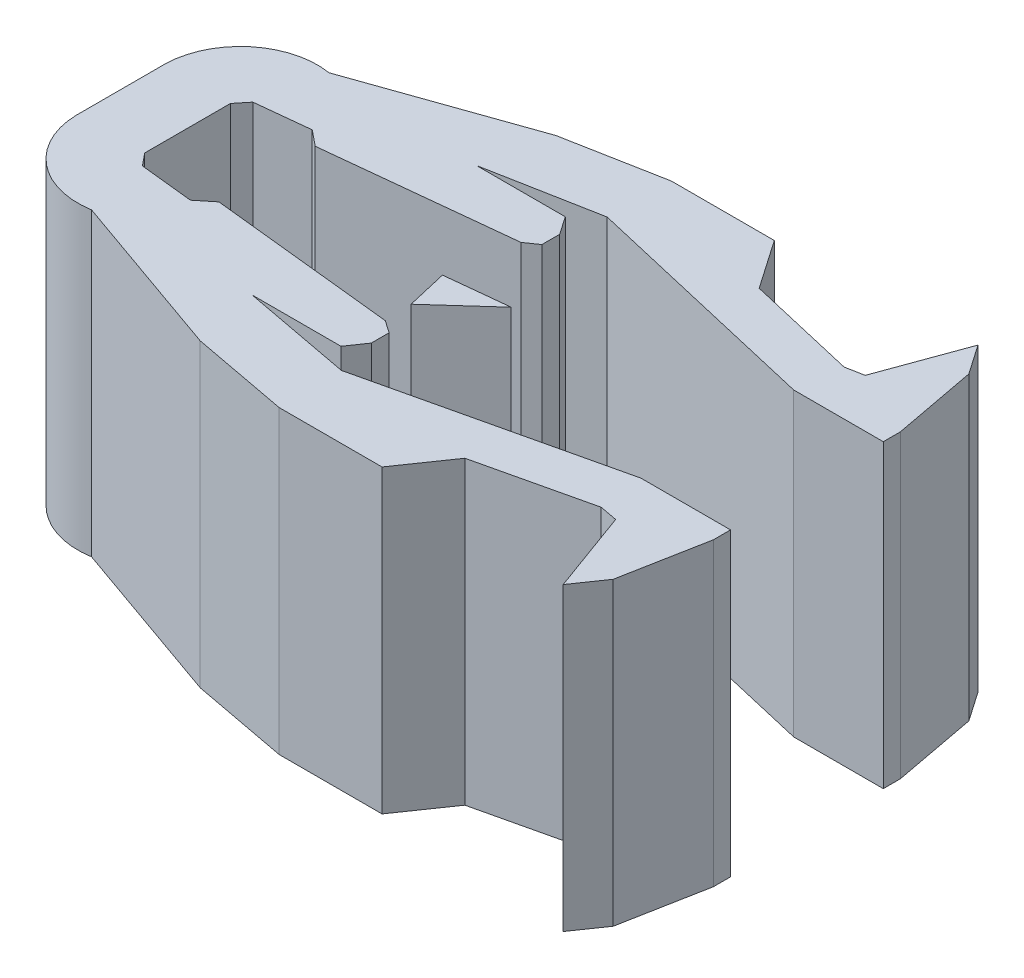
ISO-10303-21;
HEADER;
FILE_DESCRIPTION(('STEP AP214'),'2;1');
FILE_NAME('part.step','',(''),(''),'','','');
FILE_SCHEMA(('AUTOMOTIVE_DESIGN { 1 0 10303 214 1 1 1 1 }'));
ENDSEC;
DATA;
#1=APPLICATION_CONTEXT('core data for automotive mechanical design processes');
#2=APPLICATION_PROTOCOL_DEFINITION('international standard','automotive_design',2000,#1);
#3=PRODUCT_CONTEXT('',#1,'mechanical');
#4=PRODUCT('Part','Part','',(#3));
#5=PRODUCT_RELATED_PRODUCT_CATEGORY('part','',(#4));
#6=PRODUCT_DEFINITION_FORMATION('','',#4);
#7=PRODUCT_DEFINITION_CONTEXT('part definition',#1,'design');
#8=PRODUCT_DEFINITION('design','',#6,#7);
#9=PRODUCT_DEFINITION_SHAPE('','',#8);
#10=(LENGTH_UNIT() NAMED_UNIT(*) SI_UNIT(.MILLI.,.METRE.));
#11=(NAMED_UNIT(*) PLANE_ANGLE_UNIT() SI_UNIT($,.RADIAN.));
#12=(NAMED_UNIT(*) SI_UNIT($,.STERADIAN.) SOLID_ANGLE_UNIT());
#13=UNCERTAINTY_MEASURE_WITH_UNIT(LENGTH_MEASURE(1.E-05),#10,'distance_accuracy_value','');
#14=(GEOMETRIC_REPRESENTATION_CONTEXT(3) GLOBAL_UNCERTAINTY_ASSIGNED_CONTEXT((#13)) GLOBAL_UNIT_ASSIGNED_CONTEXT((#10,
#11,#12)) REPRESENTATION_CONTEXT('',''));
#15=CARTESIAN_POINT('',(0.,0.,0.));
#16=DIRECTION('',(0.,0.,1.));
#17=DIRECTION('',(1.,0.,0.));
#18=AXIS2_PLACEMENT_3D('',#15,#16,#17);
#19=CARTESIAN_POINT('',(1.91994045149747,7.5,-1.06888730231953));
#20=DIRECTION('',(0.,-1.,0.));
#21=DIRECTION('',(0.,0.,-1.));
#22=AXIS2_PLACEMENT_3D('',#19,#20,#21);
#23=CYLINDRICAL_SURFACE('',#22,1.92063672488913);
#24=CARTESIAN_POINT('',(1.91994045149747,0.,-1.06888730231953));
#25=DIRECTION('',(0.,1.,0.));
#26=DIRECTION('',(0.,0.,1.));
#27=AXIS2_PLACEMENT_3D('',#24,#25,#26);
#28=CIRCLE('',#27,1.92063672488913);
#29=CARTESIAN_POINT('',(2.23600863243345,0.,-2.96333876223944));
#30=VERTEX_POINT('',#29);
#31=CARTESIAN_POINT('',(0.,0.,-1.12059892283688));
#32=VERTEX_POINT('',#31);
#33=EDGE_CURVE('E413',#30,#32,#28,.T.);
#34=ORIENTED_EDGE('',*,*,#33,.T.);
#35=DIRECTION('',(0.,-1.,0.));
#36=VECTOR('',#35,1.);
#37=CARTESIAN_POINT('',(0.,7.5,-1.12059892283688));
#38=LINE('',#37,#36);
#39=CARTESIAN_POINT('',(0.,7.5,-1.12059892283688));
#40=VERTEX_POINT('',#39);
#41=EDGE_CURVE('E11',#40,#32,#38,.T.);
#42=ORIENTED_EDGE('',*,*,#41,.F.);
#43=CARTESIAN_POINT('',(1.91994045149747,7.5,-1.06888730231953));
#44=DIRECTION('',(0.,1.,0.));
#45=DIRECTION('',(0.,0.,1.));
#46=AXIS2_PLACEMENT_3D('',#43,#44,#45);
#47=CIRCLE('',#46,1.92063672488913);
#48=CARTESIAN_POINT('',(2.23600863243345,7.5,-2.96333876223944));
#49=VERTEX_POINT('',#48);
#50=EDGE_CURVE('E414',#49,#40,#47,.T.);
#51=ORIENTED_EDGE('',*,*,#50,.F.);
#52=DIRECTION('',(0.,-1.,0.));
#53=VECTOR('',#52,1.);
#54=CARTESIAN_POINT('',(2.23600863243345,7.5,-2.96333876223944));
#55=LINE('',#54,#53);
#56=EDGE_CURVE('E508',#49,#30,#55,.T.);
#57=ORIENTED_EDGE('',*,*,#56,.T.);
#58=EDGE_LOOP('',(#34,#42,#51,#57));
#59=FACE_BOUND('',#58,.T.);
#60=ADVANCED_FACE('F33',(#59),#23,.T.);
#61=CARTESIAN_POINT('',(0.,7.5,1.12059892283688));
#62=DIRECTION('',(1.,0.,0.));
#63=DIRECTION('',(0.,0.,-1.));
#64=AXIS2_PLACEMENT_3D('',#61,#62,#63);
#65=PLANE('',#64);
#66=DIRECTION('',(0.,0.,1.));
#67=VECTOR('',#66,1.);
#68=CARTESIAN_POINT('',(0.,0.,1.12059892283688));
#69=LINE('',#68,#67);
#70=CARTESIAN_POINT('',(0.,0.,1.12059892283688));
#71=VERTEX_POINT('',#70);
#72=EDGE_CURVE('E511',#32,#71,#69,.T.);
#73=ORIENTED_EDGE('',*,*,#72,.T.);
#74=DIRECTION('',(0.,-1.,0.));
#75=VECTOR('',#74,1.);
#76=CARTESIAN_POINT('',(0.,7.5,1.12059892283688));
#77=LINE('',#76,#75);
#78=CARTESIAN_POINT('',(0.,7.5,1.12059892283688));
#79=VERTEX_POINT('',#78);
#80=EDGE_CURVE('E40',#79,#71,#77,.T.);
#81=ORIENTED_EDGE('',*,*,#80,.F.);
#82=DIRECTION('',(0.,0.,1.));
#83=VECTOR('',#82,1.);
#84=CARTESIAN_POINT('',(0.,7.5,1.12059892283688));
#85=LINE('',#84,#83);
#86=EDGE_CURVE('E417',#40,#79,#85,.T.);
#87=ORIENTED_EDGE('',*,*,#86,.F.);
#88=ORIENTED_EDGE('',*,*,#41,.T.);
#89=EDGE_LOOP('',(#73,#81,#87,#88));
#90=FACE_BOUND('',#89,.T.);
#91=ADVANCED_FACE('F760',(#90),#65,.F.);
#92=CARTESIAN_POINT('',(1.91994045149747,7.5,1.06888730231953));
#93=DIRECTION('',(0.,-1.,0.));
#94=DIRECTION('',(0.,0.,-1.));
#95=AXIS2_PLACEMENT_3D('',#92,#93,#94);
#96=CYLINDRICAL_SURFACE('',#95,1.92063672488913);
#97=CARTESIAN_POINT('',(1.91994045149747,0.,1.06888730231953));
#98=DIRECTION('',(0.,1.,0.));
#99=DIRECTION('',(0.,0.,-1.));
#100=AXIS2_PLACEMENT_3D('',#97,#98,#99);
#101=CIRCLE('',#100,1.92063672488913);
#102=CARTESIAN_POINT('',(2.23600863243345,0.,2.96333876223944));
#103=VERTEX_POINT('',#102);
#104=EDGE_CURVE('E513',#71,#103,#101,.T.);
#105=ORIENTED_EDGE('',*,*,#104,.T.);
#106=DIRECTION('',(0.,-1.,0.));
#107=VECTOR('',#106,1.);
#108=CARTESIAN_POINT('',(2.23600863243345,7.5,2.96333876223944));
#109=LINE('',#108,#107);
#110=CARTESIAN_POINT('',(2.23600863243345,7.5,2.96333876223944));
#111=VERTEX_POINT('',#110);
#112=EDGE_CURVE('E730',#111,#103,#109,.T.);
#113=ORIENTED_EDGE('',*,*,#112,.F.);
#114=CARTESIAN_POINT('',(1.91994045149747,7.5,1.06888730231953));
#115=DIRECTION('',(0.,1.,0.));
#116=DIRECTION('',(0.,0.,-1.));
#117=AXIS2_PLACEMENT_3D('',#114,#115,#116);
#118=CIRCLE('',#117,1.92063672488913);
#119=EDGE_CURVE('E420',#79,#111,#118,.T.);
#120=ORIENTED_EDGE('',*,*,#119,.F.);
#121=ORIENTED_EDGE('',*,*,#80,.T.);
#122=EDGE_LOOP('',(#105,#113,#120,#121));
#123=FACE_BOUND('',#122,.T.);
#124=ADVANCED_FACE('F737',(#123),#96,.T.);
#125=CARTESIAN_POINT('',(2.23600863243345,7.5,2.96333876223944));
#126=DIRECTION('',(0.33222081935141,0.,-0.943201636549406));
#127=DIRECTION('',(-0.943201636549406,0.,-0.33222081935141));
#128=AXIS2_PLACEMENT_3D('',#125,#126,#127);
#129=PLANE('',#128);
#130=DIRECTION('',(0.943201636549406,0.,0.332220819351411));
#131=VECTOR('',#130,1.);
#132=CARTESIAN_POINT('',(2.23600863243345,0.,2.96333876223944));
#133=LINE('',#132,#131);
#134=CARTESIAN_POINT('',(6.42274443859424,0.,4.43801898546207));
#135=VERTEX_POINT('',#134);
#136=EDGE_CURVE('E515',#103,#135,#133,.T.);
#137=ORIENTED_EDGE('',*,*,#136,.T.);
#138=DIRECTION('',(0.,-1.,0.));
#139=VECTOR('',#138,1.);
#140=CARTESIAN_POINT('',(6.42274443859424,7.5,4.43801898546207));
#141=LINE('',#140,#139);
#142=CARTESIAN_POINT('',(6.42274443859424,7.5,4.43801898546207));
#143=VERTEX_POINT('',#142);
#144=EDGE_CURVE('E727',#143,#135,#141,.T.);
#145=ORIENTED_EDGE('',*,*,#144,.F.);
#146=DIRECTION('',(0.943201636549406,0.,0.332220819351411));
#147=VECTOR('',#146,1.);
#148=CARTESIAN_POINT('',(2.23600863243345,7.5,2.96333876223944));
#149=LINE('',#148,#147);
#150=EDGE_CURVE('E422',#111,#143,#149,.T.);
#151=ORIENTED_EDGE('',*,*,#150,.F.);
#152=ORIENTED_EDGE('',*,*,#112,.T.);
#153=EDGE_LOOP('',(#137,#145,#151,#152));
#154=FACE_BOUND('',#153,.T.);
#155=ADVANCED_FACE('F748',(#154),#129,.F.);
#156=CARTESIAN_POINT('',(6.42274443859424,7.5,4.43801898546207));
#157=DIRECTION('',(0.185148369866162,0.,-0.982710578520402));
#158=DIRECTION('',(-0.982710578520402,0.,-0.185148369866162));
#159=AXIS2_PLACEMENT_3D('',#156,#157,#158);
#160=PLANE('',#159);
#161=DIRECTION('',(0.982710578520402,0.,0.185148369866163));
#162=VECTOR('',#161,1.);
#163=CARTESIAN_POINT('',(6.42274443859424,0.,4.43801898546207));
#164=LINE('',#163,#162);
#165=CARTESIAN_POINT('',(8.85017706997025,0.,4.89536136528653));
#166=VERTEX_POINT('',#165);
#167=EDGE_CURVE('E517',#135,#166,#164,.T.);
#168=ORIENTED_EDGE('',*,*,#167,.T.);
#169=DIRECTION('',(0.,-1.,0.));
#170=VECTOR('',#169,1.);
#171=CARTESIAN_POINT('',(8.85017706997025,7.5,4.89536136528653));
#172=LINE('',#171,#170);
#173=CARTESIAN_POINT('',(8.85017706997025,7.5,4.89536136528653));
#174=VERTEX_POINT('',#173);
#175=EDGE_CURVE('E724',#174,#166,#172,.T.);
#176=ORIENTED_EDGE('',*,*,#175,.F.);
#177=DIRECTION('',(0.982710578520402,0.,0.185148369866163));
#178=VECTOR('',#177,1.);
#179=CARTESIAN_POINT('',(6.42274443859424,7.5,4.43801898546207));
#180=LINE('',#179,#178);
#181=EDGE_CURVE('E424',#143,#174,#180,.T.);
#182=ORIENTED_EDGE('',*,*,#181,.F.);
#183=ORIENTED_EDGE('',*,*,#144,.T.);
#184=EDGE_LOOP('',(#168,#176,#182,#183));
#185=FACE_BOUND('',#184,.T.);
#186=ADVANCED_FACE('F752',(#185),#160,.F.);
#187=CARTESIAN_POINT('',(8.85017706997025,7.5,4.89536136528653));
#188=DIRECTION('',(0.,0.,-1.));
#189=DIRECTION('',(-1.,0.,0.));
#190=AXIS2_PLACEMENT_3D('',#187,#188,#189);
#191=PLANE('',#190);
#192=DIRECTION('',(1.,0.,0.));
#193=VECTOR('',#192,1.);
#194=CARTESIAN_POINT('',(8.85017706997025,0.,4.89536136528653));
#195=LINE('',#194,#193);
#196=CARTESIAN_POINT('',(11.4183304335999,0.,4.89536136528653));
#197=VERTEX_POINT('',#196);
#198=EDGE_CURVE('E519',#166,#197,#195,.T.);
#199=ORIENTED_EDGE('',*,*,#198,.T.);
#200=DIRECTION('',(0.,-1.,0.));
#201=VECTOR('',#200,1.);
#202=CARTESIAN_POINT('',(11.4183304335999,7.5,4.89536136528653));
#203=LINE('',#202,#201);
#204=CARTESIAN_POINT('',(11.4183304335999,7.5,4.89536136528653));
#205=VERTEX_POINT('',#204);
#206=EDGE_CURVE('E721',#205,#197,#203,.T.);
#207=ORIENTED_EDGE('',*,*,#206,.F.);
#208=DIRECTION('',(1.,0.,0.));
#209=VECTOR('',#208,1.);
#210=CARTESIAN_POINT('',(8.85017706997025,7.5,4.89536136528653));
#211=LINE('',#210,#209);
#212=EDGE_CURVE('E426',#174,#205,#211,.T.);
#213=ORIENTED_EDGE('',*,*,#212,.F.);
#214=ORIENTED_EDGE('',*,*,#175,.T.);
#215=EDGE_LOOP('',(#199,#207,#213,#214));
#216=FACE_BOUND('',#215,.T.);
#217=ADVANCED_FACE('F961',(#216),#191,.F.);
#218=CARTESIAN_POINT('',(11.4183304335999,7.5,4.89536136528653));
#219=DIRECTION('',(-0.822830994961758,0.,-0.56828615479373));
#220=DIRECTION('',(-0.56828615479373,0.,0.822830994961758));
#221=AXIS2_PLACEMENT_3D('',#218,#219,#220);
#222=PLANE('',#221);
#223=DIRECTION('',(0.568286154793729,0.,-0.822830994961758));
#224=VECTOR('',#223,1.);
#225=CARTESIAN_POINT('',(11.4183304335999,0.,4.89536136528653));
#226=LINE('',#225,#224);
#227=CARTESIAN_POINT('',(12.262654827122,0.,3.67285000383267));
#228=VERTEX_POINT('',#227);
#229=EDGE_CURVE('E521',#197,#228,#226,.T.);
#230=ORIENTED_EDGE('',*,*,#229,.T.);
#231=DIRECTION('',(0.,-1.,0.));
#232=VECTOR('',#231,1.);
#233=CARTESIAN_POINT('',(12.262654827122,7.5,3.67285000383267));
#234=LINE('',#233,#232);
#235=CARTESIAN_POINT('',(12.262654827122,7.5,3.67285000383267));
#236=VERTEX_POINT('',#235);
#237=EDGE_CURVE('E718',#236,#228,#234,.T.);
#238=ORIENTED_EDGE('',*,*,#237,.F.);
#239=DIRECTION('',(0.568286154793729,0.,-0.822830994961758));
#240=VECTOR('',#239,1.);
#241=CARTESIAN_POINT('',(11.4183304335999,7.5,4.89536136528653));
#242=LINE('',#241,#240);
#243=EDGE_CURVE('E428',#205,#236,#242,.T.);
#244=ORIENTED_EDGE('',*,*,#243,.F.);
#245=ORIENTED_EDGE('',*,*,#206,.T.);
#246=EDGE_LOOP('',(#230,#238,#244,#245));
#247=FACE_BOUND('',#246,.T.);
#248=ADVANCED_FACE('F959',(#247),#222,.F.);
#249=CARTESIAN_POINT('',(12.262654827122,7.5,3.67285000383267));
#250=DIRECTION('',(-0.22644505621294,0.,-0.97402394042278));
#251=DIRECTION('',(-0.97402394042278,0.,0.22644505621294));
#252=AXIS2_PLACEMENT_3D('',#249,#250,#251);
#253=PLANE('',#252);
#254=DIRECTION('',(0.97402394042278,0.,-0.22644505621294));
#255=VECTOR('',#254,1.);
#256=CARTESIAN_POINT('',(12.262654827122,0.,3.67285000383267));
#257=LINE('',#256,#255);
#258=CARTESIAN_POINT('',(15.0242991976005,0.,3.03081166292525));
#259=VERTEX_POINT('',#258);
#260=EDGE_CURVE('E523',#228,#259,#257,.T.);
#261=ORIENTED_EDGE('',*,*,#260,.T.);
#262=DIRECTION('',(0.,-1.,0.));
#263=VECTOR('',#262,1.);
#264=CARTESIAN_POINT('',(15.0242991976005,7.5,3.03081166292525));
#265=LINE('',#264,#263);
#266=CARTESIAN_POINT('',(15.0242991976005,7.5,3.03081166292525));
#267=VERTEX_POINT('',#266);
#268=EDGE_CURVE('E715',#267,#259,#265,.T.);
#269=ORIENTED_EDGE('',*,*,#268,.F.);
#270=DIRECTION('',(0.97402394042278,0.,-0.22644505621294));
#271=VECTOR('',#270,1.);
#272=CARTESIAN_POINT('',(12.262654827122,7.5,3.67285000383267));
#273=LINE('',#272,#271);
#274=EDGE_CURVE('E430',#236,#267,#273,.T.);
#275=ORIENTED_EDGE('',*,*,#274,.F.);
#276=ORIENTED_EDGE('',*,*,#237,.T.);
#277=EDGE_LOOP('',(#261,#269,#275,#276));
#278=FACE_BOUND('',#277,.T.);
#279=ADVANCED_FACE('F954',(#278),#253,.F.);
#280=CARTESIAN_POINT('',(15.0242991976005,7.5,3.03081166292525));
#281=DIRECTION('',(0.185148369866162,0.,-0.982710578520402));
#282=DIRECTION('',(-0.982710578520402,0.,-0.185148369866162));
#283=AXIS2_PLACEMENT_3D('',#280,#281,#282);
#284=PLANE('',#283);
#285=DIRECTION('',(0.982710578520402,0.,0.185148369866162));
#286=VECTOR('',#285,1.);
#287=CARTESIAN_POINT('',(15.0242991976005,0.,3.03081166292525));
#288=LINE('',#287,#286);
#289=CARTESIAN_POINT('',(15.4681796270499,0.,3.11444130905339));
#290=VERTEX_POINT('',#289);
#291=EDGE_CURVE('E525',#259,#290,#288,.T.);
#292=ORIENTED_EDGE('',*,*,#291,.T.);
#293=DIRECTION('',(0.,-1.,0.));
#294=VECTOR('',#293,1.);
#295=CARTESIAN_POINT('',(15.4681796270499,7.5,3.11444130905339));
#296=LINE('',#295,#294);
#297=CARTESIAN_POINT('',(15.4681796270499,7.5,3.11444130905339));
#298=VERTEX_POINT('',#297);
#299=EDGE_CURVE('E712',#298,#290,#296,.T.);
#300=ORIENTED_EDGE('',*,*,#299,.F.);
#301=DIRECTION('',(0.982710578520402,0.,0.185148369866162));
#302=VECTOR('',#301,1.);
#303=CARTESIAN_POINT('',(15.0242991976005,7.5,3.03081166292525));
#304=LINE('',#303,#302);
#305=EDGE_CURVE('E432',#267,#298,#304,.T.);
#306=ORIENTED_EDGE('',*,*,#305,.F.);
#307=ORIENTED_EDGE('',*,*,#268,.T.);
#308=EDGE_LOOP('',(#292,#300,#306,#307));
#309=FACE_BOUND('',#308,.T.);
#310=ADVANCED_FACE('F949',(#309),#284,.F.);
#311=CARTESIAN_POINT('',(15.4681796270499,7.5,3.11444130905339));
#312=DIRECTION('',(0.939457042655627,0.,-0.342666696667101));
#313=DIRECTION('',(-0.342666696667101,0.,-0.939457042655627));
#314=AXIS2_PLACEMENT_3D('',#311,#312,#313);
#315=PLANE('',#314);
#316=DIRECTION('',(0.3426666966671,0.,0.939457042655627));
#317=VECTOR('',#316,1.);
#318=CARTESIAN_POINT('',(15.4681796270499,0.,3.11444130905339));
#319=LINE('',#318,#317);
#320=CARTESIAN_POINT('',(16.2204254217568,0.,5.17680282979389));
#321=VERTEX_POINT('',#320);
#322=EDGE_CURVE('E527',#290,#321,#319,.T.);
#323=ORIENTED_EDGE('',*,*,#322,.T.);
#324=DIRECTION('',(0.,-1.,0.));
#325=VECTOR('',#324,1.);
#326=CARTESIAN_POINT('',(16.2204254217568,7.5,5.17680282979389));
#327=LINE('',#326,#325);
#328=CARTESIAN_POINT('',(16.2204254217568,7.5,5.17680282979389));
#329=VERTEX_POINT('',#328);
#330=EDGE_CURVE('E709',#329,#321,#327,.T.);
#331=ORIENTED_EDGE('',*,*,#330,.F.);
#332=DIRECTION('',(0.3426666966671,0.,0.939457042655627));
#333=VECTOR('',#332,1.);
#334=CARTESIAN_POINT('',(15.4681796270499,7.5,3.11444130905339));
#335=LINE('',#334,#333);
#336=EDGE_CURVE('E434',#298,#329,#335,.T.);
#337=ORIENTED_EDGE('',*,*,#336,.F.);
#338=ORIENTED_EDGE('',*,*,#299,.T.);
#339=EDGE_LOOP('',(#323,#331,#337,#338));
#340=FACE_BOUND('',#339,.T.);
#341=ADVANCED_FACE('F945',(#340),#315,.F.);
#342=CARTESIAN_POINT('',(16.2204254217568,7.5,5.17680282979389));
#343=DIRECTION('',(-0.822830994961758,0.,-0.56828615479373));
#344=DIRECTION('',(-0.56828615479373,0.,0.822830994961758));
#345=AXIS2_PLACEMENT_3D('',#342,#343,#344);
#346=PLANE('',#345);
#347=DIRECTION('',(0.56828615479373,0.,-0.822830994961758));
#348=VECTOR('',#347,1.);
#349=CARTESIAN_POINT('',(16.2204254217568,0.,5.17680282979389));
#350=LINE('',#349,#348);
#351=CARTESIAN_POINT('',(16.7306646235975,0.,4.43801898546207));
#352=VERTEX_POINT('',#351);
#353=EDGE_CURVE('E529',#321,#352,#350,.T.);
#354=ORIENTED_EDGE('',*,*,#353,.T.);
#355=DIRECTION('',(0.,-1.,0.));
#356=VECTOR('',#355,1.);
#357=CARTESIAN_POINT('',(16.7306646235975,7.5,4.43801898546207));
#358=LINE('',#357,#356);
#359=CARTESIAN_POINT('',(16.7306646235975,7.5,4.43801898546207));
#360=VERTEX_POINT('',#359);
#361=EDGE_CURVE('E706',#360,#352,#358,.T.);
#362=ORIENTED_EDGE('',*,*,#361,.F.);
#363=DIRECTION('',(0.56828615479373,0.,-0.822830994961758));
#364=VECTOR('',#363,1.);
#365=CARTESIAN_POINT('',(16.2204254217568,7.5,5.17680282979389));
#366=LINE('',#365,#364);
#367=EDGE_CURVE('E436',#329,#360,#366,.T.);
#368=ORIENTED_EDGE('',*,*,#367,.F.);
#369=ORIENTED_EDGE('',*,*,#330,.T.);
#370=EDGE_LOOP('',(#354,#362,#368,#369));
#371=FACE_BOUND('',#370,.T.);
#372=ADVANCED_FACE('F940',(#371),#346,.F.);
#373=CARTESIAN_POINT('',(16.7306646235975,7.5,4.43801898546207));
#374=DIRECTION('',(-0.982710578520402,0.,-0.185148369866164));
#375=DIRECTION('',(-0.185148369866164,0.,0.982710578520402));
#376=AXIS2_PLACEMENT_3D('',#373,#374,#375);
#377=PLANE('',#376);
#378=DIRECTION('',(0.185148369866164,0.,-0.982710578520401));
#379=VECTOR('',#378,1.);
#380=CARTESIAN_POINT('',(16.7306646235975,0.,4.43801898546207));
#381=LINE('',#380,#379);
#382=CARTESIAN_POINT('',(17.127286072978,0.,2.3328743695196));
#383=VERTEX_POINT('',#382);
#384=EDGE_CURVE('E531',#352,#383,#381,.T.);
#385=ORIENTED_EDGE('',*,*,#384,.T.);
#386=DIRECTION('',(0.,-1.,0.));
#387=VECTOR('',#386,1.);
#388=CARTESIAN_POINT('',(17.127286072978,7.5,2.3328743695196));
#389=LINE('',#388,#387);
#390=CARTESIAN_POINT('',(17.127286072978,7.5,2.3328743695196));
#391=VERTEX_POINT('',#390);
#392=EDGE_CURVE('E703',#391,#383,#389,.T.);
#393=ORIENTED_EDGE('',*,*,#392,.F.);
#394=DIRECTION('',(0.185148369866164,0.,-0.982710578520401));
#395=VECTOR('',#394,1.);
#396=CARTESIAN_POINT('',(16.7306646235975,7.5,4.43801898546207));
#397=LINE('',#396,#395);
#398=EDGE_CURVE('E438',#360,#391,#397,.T.);
#399=ORIENTED_EDGE('',*,*,#398,.F.);
#400=ORIENTED_EDGE('',*,*,#361,.T.);
#401=EDGE_LOOP('',(#385,#393,#399,#400));
#402=FACE_BOUND('',#401,.T.);
#403=ADVANCED_FACE('F934',(#402),#377,.F.);
#404=CARTESIAN_POINT('',(17.127286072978,7.5,2.3328743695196));
#405=DIRECTION('',(-1.,0.,0.));
#406=DIRECTION('',(0.,0.,1.));
#407=AXIS2_PLACEMENT_3D('',#404,#405,#406);
#408=PLANE('',#407);
#409=DIRECTION('',(0.,0.,-1.));
#410=VECTOR('',#409,1.);
#411=CARTESIAN_POINT('',(17.127286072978,0.,2.3328743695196));
#412=LINE('',#411,#410);
#413=CARTESIAN_POINT('',(17.127286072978,0.,1.90617401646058));
#414=VERTEX_POINT('',#413);
#415=EDGE_CURVE('E533',#383,#414,#412,.T.);
#416=ORIENTED_EDGE('',*,*,#415,.T.);
#417=DIRECTION('',(0.,-1.,0.));
#418=VECTOR('',#417,1.);
#419=CARTESIAN_POINT('',(17.127286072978,7.5,1.90617401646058));
#420=LINE('',#419,#418);
#421=CARTESIAN_POINT('',(17.127286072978,7.5,1.90617401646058));
#422=VERTEX_POINT('',#421);
#423=EDGE_CURVE('E700',#422,#414,#420,.T.);
#424=ORIENTED_EDGE('',*,*,#423,.F.);
#425=DIRECTION('',(0.,0.,-1.));
#426=VECTOR('',#425,1.);
#427=CARTESIAN_POINT('',(17.127286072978,7.5,2.3328743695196));
#428=LINE('',#427,#426);
#429=EDGE_CURVE('E440',#391,#422,#428,.T.);
#430=ORIENTED_EDGE('',*,*,#429,.F.);
#431=ORIENTED_EDGE('',*,*,#392,.T.);
#432=EDGE_LOOP('',(#416,#424,#430,#431));
#433=FACE_BOUND('',#432,.T.);
#434=ADVANCED_FACE('F929',(#433),#408,.F.);
#435=CARTESIAN_POINT('',(16.6082589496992,7.5,1.90617401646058));
#436=DIRECTION('',(0.,0.,1.));
#437=DIRECTION('',(1.,0.,0.));
#438=AXIS2_PLACEMENT_3D('',#435,#436,#437);
#439=PLANE('',#438);
#440=DIRECTION('',(-1.,0.,0.));
#441=VECTOR('',#440,1.);
#442=CARTESIAN_POINT('',(16.6082589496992,0.,1.90617401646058));
#443=LINE('',#442,#441);
#444=CARTESIAN_POINT('',(14.8912010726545,0.,1.90617401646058));
#445=VERTEX_POINT('',#444);
#446=EDGE_CURVE('E536',#414,#445,#443,.T.);
#447=ORIENTED_EDGE('',*,*,#446,.T.);
#448=DIRECTION('',(0.,-1.,0.));
#449=VECTOR('',#448,1.);
#450=CARTESIAN_POINT('',(14.8912010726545,7.5,1.90617401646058));
#451=LINE('',#450,#449);
#452=CARTESIAN_POINT('',(14.8912010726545,7.5,1.90617401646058));
#453=VERTEX_POINT('',#452);
#454=EDGE_CURVE('E697',#453,#445,#451,.T.);
#455=ORIENTED_EDGE('',*,*,#454,.F.);
#456=DIRECTION('',(-1.,0.,0.));
#457=VECTOR('',#456,1.);
#458=CARTESIAN_POINT('',(17.127286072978,7.5,1.90617401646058));
#459=LINE('',#458,#457);
#460=EDGE_CURVE('E442',#422,#453,#459,.T.);
#461=ORIENTED_EDGE('',*,*,#460,.F.);
#462=ORIENTED_EDGE('',*,*,#423,.T.);
#463=EDGE_LOOP('',(#447,#455,#461,#462));
#464=FACE_BOUND('',#463,.T.);
#465=ADVANCED_FACE('F924',(#464),#439,.F.);
#466=CARTESIAN_POINT('',(14.8912010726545,7.5,1.90617401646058));
#467=DIRECTION('',(0.22644505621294,0.,0.97402394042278));
#468=DIRECTION('',(0.97402394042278,0.,-0.22644505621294));
#469=AXIS2_PLACEMENT_3D('',#466,#467,#468);
#470=PLANE('',#469);
#471=DIRECTION('',(-0.97402394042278,0.,0.22644505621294));
#472=VECTOR('',#471,1.);
#473=CARTESIAN_POINT('',(14.8912010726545,0.,1.90617401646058));
#474=LINE('',#473,#472);
#475=CARTESIAN_POINT('',(8.82528276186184,0.,3.31640343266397));
#476=VERTEX_POINT('',#475);
#477=EDGE_CURVE('E538',#445,#476,#474,.T.);
#478=ORIENTED_EDGE('',*,*,#477,.T.);
#479=DIRECTION('',(0.,-1.,0.));
#480=VECTOR('',#479,1.);
#481=CARTESIAN_POINT('',(8.82528276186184,7.5,3.31640343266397));
#482=LINE('',#481,#480);
#483=CARTESIAN_POINT('',(8.82528276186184,7.5,3.31640343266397));
#484=VERTEX_POINT('',#483);
#485=EDGE_CURVE('E694',#484,#476,#482,.T.);
#486=ORIENTED_EDGE('',*,*,#485,.F.);
#487=DIRECTION('',(-0.97402394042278,0.,0.22644505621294));
#488=VECTOR('',#487,1.);
#489=CARTESIAN_POINT('',(14.8912010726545,7.5,1.90617401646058));
#490=LINE('',#489,#488);
#491=EDGE_CURVE('E444',#453,#484,#490,.T.);
#492=ORIENTED_EDGE('',*,*,#491,.F.);
#493=ORIENTED_EDGE('',*,*,#454,.T.);
#494=EDGE_LOOP('',(#478,#486,#492,#493));
#495=FACE_BOUND('',#494,.T.);
#496=ADVANCED_FACE('F920',(#495),#470,.F.);
#497=CARTESIAN_POINT('',(8.82528276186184,7.5,3.31640343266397));
#498=DIRECTION('',(-0.185148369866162,0.,0.982710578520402));
#499=DIRECTION('',(0.982710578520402,0.,0.185148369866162));
#500=AXIS2_PLACEMENT_3D('',#497,#498,#499);
#501=PLANE('',#500);
#502=DIRECTION('',(-0.982710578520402,0.,-0.185148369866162));
#503=VECTOR('',#502,1.);
#504=CARTESIAN_POINT('',(8.82528276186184,0.,3.31640343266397));
#505=LINE('',#504,#503);
#506=CARTESIAN_POINT('',(6.07903676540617,0.,2.79899476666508));
#507=VERTEX_POINT('',#506);
#508=EDGE_CURVE('E540',#476,#507,#505,.T.);
#509=ORIENTED_EDGE('',*,*,#508,.T.);
#510=DIRECTION('',(0.,-1.,0.));
#511=VECTOR('',#510,1.);
#512=CARTESIAN_POINT('',(6.07903676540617,7.5,2.79899476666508));
#513=LINE('',#512,#511);
#514=CARTESIAN_POINT('',(6.07903676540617,7.5,2.79899476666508));
#515=VERTEX_POINT('',#514);
#516=EDGE_CURVE('E691',#515,#507,#513,.T.);
#517=ORIENTED_EDGE('',*,*,#516,.F.);
#518=DIRECTION('',(-0.982710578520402,0.,-0.185148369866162));
#519=VECTOR('',#518,1.);
#520=CARTESIAN_POINT('',(8.82528276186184,7.5,3.31640343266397));
#521=LINE('',#520,#519);
#522=EDGE_CURVE('E446',#484,#515,#521,.T.);
#523=ORIENTED_EDGE('',*,*,#522,.F.);
#524=ORIENTED_EDGE('',*,*,#485,.T.);
#525=EDGE_LOOP('',(#509,#517,#523,#524));
#526=FACE_BOUND('',#525,.T.);
#527=ADVANCED_FACE('F915',(#526),#501,.F.);
#528=CARTESIAN_POINT('',(6.07903676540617,7.5,2.79899476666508));
#529=DIRECTION('',(0.,0.,-1.));
#530=DIRECTION('',(-1.,0.,0.));
#531=AXIS2_PLACEMENT_3D('',#528,#529,#530);
#532=PLANE('',#531);
#533=DIRECTION('',(1.,0.,0.));
#534=VECTOR('',#533,1.);
#535=CARTESIAN_POINT('',(6.07903676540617,0.,2.79899476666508));
#536=LINE('',#535,#534);
#537=CARTESIAN_POINT('',(8.29687742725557,0.,2.79899476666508));
#538=VERTEX_POINT('',#537);
#539=EDGE_CURVE('E542',#507,#538,#536,.T.);
#540=ORIENTED_EDGE('',*,*,#539,.T.);
#541=DIRECTION('',(0.,-1.,0.));
#542=VECTOR('',#541,1.);
#543=CARTESIAN_POINT('',(8.29687742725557,7.5,2.79899476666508));
#544=LINE('',#543,#542);
#545=CARTESIAN_POINT('',(8.29687742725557,7.5,2.79899476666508));
#546=VERTEX_POINT('',#545);
#547=EDGE_CURVE('E688',#546,#538,#544,.T.);
#548=ORIENTED_EDGE('',*,*,#547,.F.);
#549=DIRECTION('',(1.,0.,0.));
#550=VECTOR('',#549,1.);
#551=CARTESIAN_POINT('',(6.07903676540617,7.5,2.79899476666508));
#552=LINE('',#551,#550);
#553=EDGE_CURVE('E448',#515,#546,#552,.T.);
#554=ORIENTED_EDGE('',*,*,#553,.F.);
#555=ORIENTED_EDGE('',*,*,#516,.T.);
#556=EDGE_LOOP('',(#540,#548,#554,#555));
#557=FACE_BOUND('',#556,.T.);
#558=ADVANCED_FACE('F910',(#557),#532,.F.);
#559=CARTESIAN_POINT('',(8.29687742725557,7.5,2.79899476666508));
#560=DIRECTION('',(-0.822830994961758,0.,-0.568286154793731));
#561=DIRECTION('',(-0.568286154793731,0.,0.822830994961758));
#562=AXIS2_PLACEMENT_3D('',#559,#560,#561);
#563=PLANE('',#562);
#564=DIRECTION('',(0.56828615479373,0.,-0.822830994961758));
#565=VECTOR('',#564,1.);
#566=CARTESIAN_POINT('',(8.29687742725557,0.,2.79899476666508));
#567=LINE('',#566,#565);
#568=CARTESIAN_POINT('',(8.60587455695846,0.,2.3515926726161));
#569=VERTEX_POINT('',#568);
#570=EDGE_CURVE('E544',#538,#569,#567,.T.);
#571=ORIENTED_EDGE('',*,*,#570,.T.);
#572=DIRECTION('',(0.,-1.,0.));
#573=VECTOR('',#572,1.);
#574=CARTESIAN_POINT('',(8.60587455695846,7.5,2.3515926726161));
#575=LINE('',#574,#573);
#576=CARTESIAN_POINT('',(8.60587455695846,7.5,2.3515926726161));
#577=VERTEX_POINT('',#576);
#578=EDGE_CURVE('E685',#577,#569,#575,.T.);
#579=ORIENTED_EDGE('',*,*,#578,.F.);
#580=DIRECTION('',(0.56828615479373,0.,-0.822830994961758));
#581=VECTOR('',#580,1.);
#582=CARTESIAN_POINT('',(8.29687742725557,7.5,2.79899476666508));
#583=LINE('',#582,#581);
#584=EDGE_CURVE('E450',#546,#577,#583,.T.);
#585=ORIENTED_EDGE('',*,*,#584,.F.);
#586=ORIENTED_EDGE('',*,*,#547,.T.);
#587=EDGE_LOOP('',(#571,#579,#585,#586));
#588=FACE_BOUND('',#587,.T.);
#589=ADVANCED_FACE('F906',(#588),#563,.F.);
#590=CARTESIAN_POINT('',(8.60587455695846,7.5,2.3515926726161));
#591=DIRECTION('',(-1.,0.,0.));
#592=DIRECTION('',(0.,0.,1.));
#593=AXIS2_PLACEMENT_3D('',#590,#591,#592);
#594=PLANE('',#593);
#595=DIRECTION('',(0.,0.,-1.));
#596=VECTOR('',#595,1.);
#597=CARTESIAN_POINT('',(8.60587455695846,0.,2.3515926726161));
#598=LINE('',#597,#596);
#599=CARTESIAN_POINT('',(8.60587455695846,0.,1.90617401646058));
#600=VERTEX_POINT('',#599);
#601=EDGE_CURVE('E546',#569,#600,#598,.T.);
#602=ORIENTED_EDGE('',*,*,#601,.T.);
#603=DIRECTION('',(0.,-1.,0.));
#604=VECTOR('',#603,1.);
#605=CARTESIAN_POINT('',(8.60587455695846,7.5,1.90617401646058));
#606=LINE('',#605,#604);
#607=CARTESIAN_POINT('',(8.60587455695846,7.5,1.90617401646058));
#608=VERTEX_POINT('',#607);
#609=EDGE_CURVE('E682',#608,#600,#606,.T.);
#610=ORIENTED_EDGE('',*,*,#609,.F.);
#611=DIRECTION('',(0.,0.,-1.));
#612=VECTOR('',#611,1.);
#613=CARTESIAN_POINT('',(8.60587455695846,7.5,2.3515926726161));
#614=LINE('',#613,#612);
#615=EDGE_CURVE('E452',#577,#608,#614,.T.);
#616=ORIENTED_EDGE('',*,*,#615,.F.);
#617=ORIENTED_EDGE('',*,*,#578,.T.);
#618=EDGE_LOOP('',(#602,#610,#616,#617));
#619=FACE_BOUND('',#618,.T.);
#620=ADVANCED_FACE('F901',(#619),#594,.F.);
#621=CARTESIAN_POINT('',(8.60587455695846,7.5,1.90617401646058));
#622=DIRECTION('',(-0.56828615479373,0.,0.822830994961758));
#623=DIRECTION('',(0.822830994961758,0.,0.56828615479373));
#624=AXIS2_PLACEMENT_3D('',#621,#622,#623);
#625=PLANE('',#624);
#626=DIRECTION('',(-0.822830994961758,0.,-0.56828615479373));
#627=VECTOR('',#626,1.);
#628=CARTESIAN_POINT('',(8.60587455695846,0.,1.90617401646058));
#629=LINE('',#628,#627);
#630=CARTESIAN_POINT('',(8.29687742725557,0.,1.69276592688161));
#631=VERTEX_POINT('',#630);
#632=EDGE_CURVE('E548',#600,#631,#629,.T.);
#633=ORIENTED_EDGE('',*,*,#632,.T.);
#634=DIRECTION('',(0.,-1.,0.));
#635=VECTOR('',#634,1.);
#636=CARTESIAN_POINT('',(8.29687742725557,7.5,1.69276592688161));
#637=LINE('',#636,#635);
#638=CARTESIAN_POINT('',(8.29687742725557,7.5,1.69276592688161));
#639=VERTEX_POINT('',#638);
#640=EDGE_CURVE('E679',#639,#631,#637,.T.);
#641=ORIENTED_EDGE('',*,*,#640,.F.);
#642=DIRECTION('',(-0.822830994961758,0.,-0.56828615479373));
#643=VECTOR('',#642,1.);
#644=CARTESIAN_POINT('',(8.60587455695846,7.5,1.90617401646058));
#645=LINE('',#644,#643);
#646=EDGE_CURVE('E454',#608,#639,#645,.T.);
#647=ORIENTED_EDGE('',*,*,#646,.F.);
#648=ORIENTED_EDGE('',*,*,#609,.T.);
#649=EDGE_LOOP('',(#633,#641,#647,#648));
#650=FACE_BOUND('',#649,.T.);
#651=ADVANCED_FACE('F895',(#650),#625,.F.);
#652=CARTESIAN_POINT('',(8.29687742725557,7.5,1.69276592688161));
#653=DIRECTION('',(-0.104976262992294,0.,0.994474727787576));
#654=DIRECTION('',(0.994474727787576,0.,0.104976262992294));
#655=AXIS2_PLACEMENT_3D('',#652,#653,#654);
#656=PLANE('',#655);
#657=DIRECTION('',(0.,-1.,0.));
#658=VECTOR('',#657,1.);
#659=CARTESIAN_POINT('',(8.07652959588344,6.,1.66950611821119));
#660=LINE('',#659,#658);
#661=CARTESIAN_POINT('',(8.07652959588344,6.,1.66950611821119));
#662=VERTEX_POINT('',#661);
#663=CARTESIAN_POINT('',(8.07652959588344,1.5,1.66950611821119));
#664=VERTEX_POINT('',#663);
#665=EDGE_CURVE('E47',#662,#664,#660,.T.);
#666=ORIENTED_EDGE('',*,*,#665,.F.);
#667=DIRECTION('',(-0.994474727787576,0.,-0.104976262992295));
#668=VECTOR('',#667,1.);
#669=CARTESIAN_POINT('',(-0.0852866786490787,6.,0.80794880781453));
#670=LINE('',#669,#668);
#671=CARTESIAN_POINT('',(6.52560401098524,6.,1.50579117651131));
#672=VERTEX_POINT('',#671);
#673=EDGE_CURVE('E51',#662,#672,#670,.T.);
#674=ORIENTED_EDGE('',*,*,#673,.T.);
#675=DIRECTION('',(0.,-1.,0.));
#676=VECTOR('',#675,1.);
#677=CARTESIAN_POINT('',(6.52560401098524,6.,1.50579117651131));
#678=LINE('',#677,#676);
#679=CARTESIAN_POINT('',(6.52560401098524,1.5,1.50579117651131));
#680=VERTEX_POINT('',#679);
#681=EDGE_CURVE('E369',#672,#680,#678,.T.);
#682=ORIENTED_EDGE('',*,*,#681,.T.);
#683=DIRECTION('',(-0.994474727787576,0.,-0.104976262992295));
#684=VECTOR('',#683,1.);
#685=CARTESIAN_POINT('',(-0.0852866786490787,1.5,0.80794880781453));
#686=LINE('',#685,#684);
#687=EDGE_CURVE('E381',#664,#680,#686,.T.);
#688=ORIENTED_EDGE('',*,*,#687,.F.);
#689=EDGE_LOOP('',(#666,#674,#682,#688));
#690=FACE_BOUND('',#689,.T.);
#691=DIRECTION('',(-0.994474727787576,0.,-0.104976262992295));
#692=VECTOR('',#691,1.);
#693=CARTESIAN_POINT('',(8.29687742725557,0.,1.69276592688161));
#694=LINE('',#693,#692);
#695=CARTESIAN_POINT('',(3.65309326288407,0.,1.20257035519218));
#696=VERTEX_POINT('',#695);
#697=EDGE_CURVE('E550',#631,#696,#694,.T.);
#698=ORIENTED_EDGE('',*,*,#697,.T.);
#699=DIRECTION('',(0.,-1.,0.));
#700=VECTOR('',#699,1.);
#701=CARTESIAN_POINT('',(3.65309326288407,7.5,1.20257035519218));
#702=LINE('',#701,#700);
#703=CARTESIAN_POINT('',(3.65309326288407,7.5,1.20257035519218));
#704=VERTEX_POINT('',#703);
#705=EDGE_CURVE('E676',#704,#696,#702,.T.);
#706=ORIENTED_EDGE('',*,*,#705,.F.);
#707=DIRECTION('',(-0.994474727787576,0.,-0.104976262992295));
#708=VECTOR('',#707,1.);
#709=CARTESIAN_POINT('',(8.29687742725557,7.5,1.69276592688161));
#710=LINE('',#709,#708);
#711=EDGE_CURVE('E456',#639,#704,#710,.T.);
#712=ORIENTED_EDGE('',*,*,#711,.F.);
#713=ORIENTED_EDGE('',*,*,#640,.T.);
#714=EDGE_LOOP('',(#698,#706,#712,#713));
#715=FACE_BOUND('',#714,.T.);
#716=ADVANCED_FACE('F891',(#690,#715),#656,.F.);
#717=CARTESIAN_POINT('',(3.65309326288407,7.5,1.20257035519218));
#718=DIRECTION('',(0.628970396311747,0.,0.777429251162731));
#719=DIRECTION('',(0.777429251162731,0.,-0.628970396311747));
#720=AXIS2_PLACEMENT_3D('',#717,#718,#719);
#721=PLANE('',#720);
#722=DIRECTION('',(-0.777429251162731,0.,0.628970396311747));
#723=VECTOR('',#722,1.);
#724=CARTESIAN_POINT('',(3.65309326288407,0.,1.20257035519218));
#725=LINE('',#724,#723);
#726=CARTESIAN_POINT('',(3.26032077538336,0.,1.52033852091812));
#727=VERTEX_POINT('',#726);
#728=EDGE_CURVE('E552',#696,#727,#725,.T.);
#729=ORIENTED_EDGE('',*,*,#728,.T.);
#730=DIRECTION('',(0.,-1.,0.));
#731=VECTOR('',#730,1.);
#732=CARTESIAN_POINT('',(3.26032077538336,7.5,1.52033852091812));
#733=LINE('',#732,#731);
#734=CARTESIAN_POINT('',(3.26032077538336,7.5,1.52033852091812));
#735=VERTEX_POINT('',#734);
#736=EDGE_CURVE('E673',#735,#727,#733,.T.);
#737=ORIENTED_EDGE('',*,*,#736,.F.);
#738=DIRECTION('',(-0.777429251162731,0.,0.628970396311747));
#739=VECTOR('',#738,1.);
#740=CARTESIAN_POINT('',(3.65309326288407,7.5,1.20257035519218));
#741=LINE('',#740,#739);
#742=EDGE_CURVE('E458',#704,#735,#741,.T.);
#743=ORIENTED_EDGE('',*,*,#742,.F.);
#744=ORIENTED_EDGE('',*,*,#705,.T.);
#745=EDGE_LOOP('',(#729,#737,#743,#744));
#746=FACE_BOUND('',#745,.T.);
#747=ADVANCED_FACE('F886',(#746),#721,.F.);
#748=CARTESIAN_POINT('',(3.26032077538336,7.5,1.52033852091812));
#749=DIRECTION('',(-0.104976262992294,0.,0.994474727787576));
#750=DIRECTION('',(0.994474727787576,0.,0.104976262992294));
#751=AXIS2_PLACEMENT_3D('',#748,#749,#750);
#752=PLANE('',#751);
#753=DIRECTION('',(-0.994474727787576,0.,-0.104976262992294));
#754=VECTOR('',#753,1.);
#755=CARTESIAN_POINT('',(3.26032077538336,0.,1.52033852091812));
#756=LINE('',#755,#754);
#757=CARTESIAN_POINT('',(1.91994045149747,0.,1.37884863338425));
#758=VERTEX_POINT('',#757);
#759=EDGE_CURVE('E554',#727,#758,#756,.T.);
#760=ORIENTED_EDGE('',*,*,#759,.T.);
#761=DIRECTION('',(0.,-1.,0.));
#762=VECTOR('',#761,1.);
#763=CARTESIAN_POINT('',(1.91994045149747,7.5,1.37884863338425));
#764=LINE('',#763,#762);
#765=CARTESIAN_POINT('',(1.91994045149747,7.5,1.37884863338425));
#766=VERTEX_POINT('',#765);
#767=EDGE_CURVE('E670',#766,#758,#764,.T.);
#768=ORIENTED_EDGE('',*,*,#767,.F.);
#769=DIRECTION('',(-0.994474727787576,0.,-0.104976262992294));
#770=VECTOR('',#769,1.);
#771=CARTESIAN_POINT('',(3.26032077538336,7.5,1.52033852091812));
#772=LINE('',#771,#770);
#773=EDGE_CURVE('E460',#735,#766,#772,.T.);
#774=ORIENTED_EDGE('',*,*,#773,.F.);
#775=ORIENTED_EDGE('',*,*,#736,.T.);
#776=EDGE_LOOP('',(#760,#768,#774,#775));
#777=FACE_BOUND('',#776,.T.);
#778=ADVANCED_FACE('F880',(#777),#752,.F.);
#779=CARTESIAN_POINT('',(1.91994045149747,7.5,1.37884863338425));
#780=DIRECTION('',(-0.777429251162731,0.,0.628970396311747));
#781=DIRECTION('',(0.628970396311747,0.,0.777429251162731));
#782=AXIS2_PLACEMENT_3D('',#779,#780,#781);
#783=PLANE('',#782);
#784=DIRECTION('',(-0.628970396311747,0.,-0.777429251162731));
#785=VECTOR('',#784,1.);
#786=CARTESIAN_POINT('',(1.91994045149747,0.,1.37884863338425));
#787=LINE('',#786,#785);
#788=CARTESIAN_POINT('',(1.66916972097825,0.,1.06888730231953));
#789=VERTEX_POINT('',#788);
#790=EDGE_CURVE('E556',#758,#789,#787,.T.);
#791=ORIENTED_EDGE('',*,*,#790,.T.);
#792=DIRECTION('',(0.,-1.,0.));
#793=VECTOR('',#792,1.);
#794=CARTESIAN_POINT('',(1.66916972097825,7.5,1.06888730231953));
#795=LINE('',#794,#793);
#796=CARTESIAN_POINT('',(1.66916972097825,7.5,1.06888730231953));
#797=VERTEX_POINT('',#796);
#798=EDGE_CURVE('E667',#797,#789,#795,.T.);
#799=ORIENTED_EDGE('',*,*,#798,.F.);
#800=DIRECTION('',(-0.628970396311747,0.,-0.777429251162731));
#801=VECTOR('',#800,1.);
#802=CARTESIAN_POINT('',(1.91994045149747,7.5,1.37884863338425));
#803=LINE('',#802,#801);
#804=EDGE_CURVE('E462',#766,#797,#803,.T.);
#805=ORIENTED_EDGE('',*,*,#804,.F.);
#806=ORIENTED_EDGE('',*,*,#767,.T.);
#807=EDGE_LOOP('',(#791,#799,#805,#806));
#808=FACE_BOUND('',#807,.T.);
#809=ADVANCED_FACE('F876',(#808),#783,.F.);
#810=CARTESIAN_POINT('',(1.66916972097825,7.5,-1.06888730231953));
#811=DIRECTION('',(-1.,0.,0.));
#812=DIRECTION('',(0.,0.,1.));
#813=AXIS2_PLACEMENT_3D('',#810,#811,#812);
#814=PLANE('',#813);
#815=DIRECTION('',(0.,0.,-1.));
#816=VECTOR('',#815,1.);
#817=CARTESIAN_POINT('',(1.66916972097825,0.,-1.06888730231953));
#818=LINE('',#817,#816);
#819=CARTESIAN_POINT('',(1.66916972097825,0.,-1.06888730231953));
#820=VERTEX_POINT('',#819);
#821=EDGE_CURVE('E558',#789,#820,#818,.T.);
#822=ORIENTED_EDGE('',*,*,#821,.T.);
#823=DIRECTION('',(0.,-1.,0.));
#824=VECTOR('',#823,1.);
#825=CARTESIAN_POINT('',(1.66916972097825,7.5,-1.06888730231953));
#826=LINE('',#825,#824);
#827=CARTESIAN_POINT('',(1.66916972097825,7.5,-1.06888730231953));
#828=VERTEX_POINT('',#827);
#829=EDGE_CURVE('E664',#828,#820,#826,.T.);
#830=ORIENTED_EDGE('',*,*,#829,.F.);
#831=DIRECTION('',(0.,0.,-1.));
#832=VECTOR('',#831,1.);
#833=CARTESIAN_POINT('',(1.66916972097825,7.5,-1.06888730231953));
#834=LINE('',#833,#832);
#835=EDGE_CURVE('E464',#797,#828,#834,.T.);
#836=ORIENTED_EDGE('',*,*,#835,.F.);
#837=ORIENTED_EDGE('',*,*,#798,.T.);
#838=EDGE_LOOP('',(#822,#830,#836,#837));
#839=FACE_BOUND('',#838,.T.);
#840=ADVANCED_FACE('F871',(#839),#814,.F.);
#841=CARTESIAN_POINT('',(1.91994045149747,7.5,-1.37884863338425));
#842=DIRECTION('',(-0.777429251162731,0.,-0.628970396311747));
#843=DIRECTION('',(-0.628970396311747,0.,0.777429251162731));
#844=AXIS2_PLACEMENT_3D('',#841,#842,#843);
#845=PLANE('',#844);
#846=DIRECTION('',(0.628970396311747,0.,-0.777429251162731));
#847=VECTOR('',#846,1.);
#848=CARTESIAN_POINT('',(1.91994045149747,0.,-1.37884863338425));
#849=LINE('',#848,#847);
#850=CARTESIAN_POINT('',(1.91994045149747,0.,-1.37884863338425));
#851=VERTEX_POINT('',#850);
#852=EDGE_CURVE('E560',#820,#851,#849,.T.);
#853=ORIENTED_EDGE('',*,*,#852,.T.);
#854=DIRECTION('',(0.,-1.,0.));
#855=VECTOR('',#854,1.);
#856=CARTESIAN_POINT('',(1.91994045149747,7.5,-1.37884863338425));
#857=LINE('',#856,#855);
#858=CARTESIAN_POINT('',(1.91994045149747,7.5,-1.37884863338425));
#859=VERTEX_POINT('',#858);
#860=EDGE_CURVE('E661',#859,#851,#857,.T.);
#861=ORIENTED_EDGE('',*,*,#860,.F.);
#862=DIRECTION('',(0.628970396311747,0.,-0.777429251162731));
#863=VECTOR('',#862,1.);
#864=CARTESIAN_POINT('',(1.91994045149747,7.5,-1.37884863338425));
#865=LINE('',#864,#863);
#866=EDGE_CURVE('E466',#828,#859,#865,.T.);
#867=ORIENTED_EDGE('',*,*,#866,.F.);
#868=ORIENTED_EDGE('',*,*,#829,.T.);
#869=EDGE_LOOP('',(#853,#861,#867,#868));
#870=FACE_BOUND('',#869,.T.);
#871=ADVANCED_FACE('F865',(#870),#845,.F.);
#872=CARTESIAN_POINT('',(3.26032077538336,7.5,-1.52033852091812));
#873=DIRECTION('',(-0.104976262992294,0.,-0.994474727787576));
#874=DIRECTION('',(-0.994474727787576,0.,0.104976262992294));
#875=AXIS2_PLACEMENT_3D('',#872,#873,#874);
#876=PLANE('',#875);
#877=DIRECTION('',(0.994474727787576,0.,-0.104976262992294));
#878=VECTOR('',#877,1.);
#879=CARTESIAN_POINT('',(3.26032077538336,0.,-1.52033852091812));
#880=LINE('',#879,#878);
#881=CARTESIAN_POINT('',(3.26032077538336,0.,-1.52033852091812));
#882=VERTEX_POINT('',#881);
#883=EDGE_CURVE('E562',#851,#882,#880,.T.);
#884=ORIENTED_EDGE('',*,*,#883,.T.);
#885=DIRECTION('',(0.,-1.,0.));
#886=VECTOR('',#885,1.);
#887=CARTESIAN_POINT('',(3.26032077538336,7.5,-1.52033852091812));
#888=LINE('',#887,#886);
#889=CARTESIAN_POINT('',(3.26032077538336,7.5,-1.52033852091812));
#890=VERTEX_POINT('',#889);
#891=EDGE_CURVE('E658',#890,#882,#888,.T.);
#892=ORIENTED_EDGE('',*,*,#891,.F.);
#893=DIRECTION('',(0.994474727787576,0.,-0.104976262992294));
#894=VECTOR('',#893,1.);
#895=CARTESIAN_POINT('',(3.26032077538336,7.5,-1.52033852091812));
#896=LINE('',#895,#894);
#897=EDGE_CURVE('E468',#859,#890,#896,.T.);
#898=ORIENTED_EDGE('',*,*,#897,.F.);
#899=ORIENTED_EDGE('',*,*,#860,.T.);
#900=EDGE_LOOP('',(#884,#892,#898,#899));
#901=FACE_BOUND('',#900,.T.);
#902=ADVANCED_FACE('F861',(#901),#876,.F.);
#903=CARTESIAN_POINT('',(3.65309326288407,7.5,-1.20257035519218));
#904=DIRECTION('',(0.628970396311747,0.,-0.777429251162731));
#905=DIRECTION('',(-0.777429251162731,0.,-0.628970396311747));
#906=AXIS2_PLACEMENT_3D('',#903,#904,#905);
#907=PLANE('',#906);
#908=DIRECTION('',(0.777429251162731,0.,0.628970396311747));
#909=VECTOR('',#908,1.);
#910=CARTESIAN_POINT('',(3.65309326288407,0.,-1.20257035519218));
#911=LINE('',#910,#909);
#912=CARTESIAN_POINT('',(3.65309326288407,0.,-1.20257035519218));
#913=VERTEX_POINT('',#912);
#914=EDGE_CURVE('E564',#882,#913,#911,.T.);
#915=ORIENTED_EDGE('',*,*,#914,.T.);
#916=DIRECTION('',(0.,-1.,0.));
#917=VECTOR('',#916,1.);
#918=CARTESIAN_POINT('',(3.65309326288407,7.5,-1.20257035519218));
#919=LINE('',#918,#917);
#920=CARTESIAN_POINT('',(3.65309326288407,7.5,-1.20257035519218));
#921=VERTEX_POINT('',#920);
#922=EDGE_CURVE('E655',#921,#913,#919,.T.);
#923=ORIENTED_EDGE('',*,*,#922,.F.);
#924=DIRECTION('',(0.777429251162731,0.,0.628970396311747));
#925=VECTOR('',#924,1.);
#926=CARTESIAN_POINT('',(3.65309326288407,7.5,-1.20257035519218));
#927=LINE('',#926,#925);
#928=EDGE_CURVE('E470',#890,#921,#927,.T.);
#929=ORIENTED_EDGE('',*,*,#928,.F.);
#930=ORIENTED_EDGE('',*,*,#891,.T.);
#931=EDGE_LOOP('',(#915,#923,#929,#930));
#932=FACE_BOUND('',#931,.T.);
#933=ADVANCED_FACE('F856',(#932),#907,.F.);
#934=CARTESIAN_POINT('',(8.29687742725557,7.5,-1.69276592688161));
#935=DIRECTION('',(-0.104976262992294,0.,-0.994474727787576));
#936=DIRECTION('',(-0.994474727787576,0.,0.104976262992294));
#937=AXIS2_PLACEMENT_3D('',#934,#935,#936);
#938=PLANE('',#937);
#939=DIRECTION('',(0.,-1.,0.));
#940=VECTOR('',#939,1.);
#941=CARTESIAN_POINT('',(6.52560401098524,6.,-1.50579117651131));
#942=LINE('',#941,#940);
#943=CARTESIAN_POINT('',(6.52560401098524,6.,-1.50579117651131));
#944=VERTEX_POINT('',#943);
#945=CARTESIAN_POINT('',(6.52560401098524,1.5,-1.50579117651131));
#946=VERTEX_POINT('',#945);
#947=EDGE_CURVE('E399',#944,#946,#942,.T.);
#948=ORIENTED_EDGE('',*,*,#947,.F.);
#949=DIRECTION('',(-0.994474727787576,0.,0.104976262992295));
#950=VECTOR('',#949,1.);
#951=CARTESIAN_POINT('',(-0.0852866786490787,6.,-0.80794880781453));
#952=LINE('',#951,#950);
#953=CARTESIAN_POINT('',(8.07652959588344,6.,-1.66950611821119));
#954=VERTEX_POINT('',#953);
#955=EDGE_CURVE('E396',#954,#944,#952,.T.);
#956=ORIENTED_EDGE('',*,*,#955,.F.);
#957=DIRECTION('',(0.,-1.,0.));
#958=VECTOR('',#957,1.);
#959=CARTESIAN_POINT('',(8.07652959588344,6.,-1.66950611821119));
#960=LINE('',#959,#958);
#961=CARTESIAN_POINT('',(8.07652959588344,1.5,-1.66950611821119));
#962=VERTEX_POINT('',#961);
#963=EDGE_CURVE('E408',#954,#962,#960,.T.);
#964=ORIENTED_EDGE('',*,*,#963,.T.);
#965=DIRECTION('',(-0.994474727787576,0.,0.104976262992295));
#966=VECTOR('',#965,1.);
#967=CARTESIAN_POINT('',(-0.0852866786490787,1.5,-0.80794880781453));
#968=LINE('',#967,#966);
#969=EDGE_CURVE('E393',#962,#946,#968,.T.);
#970=ORIENTED_EDGE('',*,*,#969,.T.);
#971=EDGE_LOOP('',(#948,#956,#964,#970));
#972=FACE_BOUND('',#971,.T.);
#973=DIRECTION('',(0.994474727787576,0.,-0.104976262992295));
#974=VECTOR('',#973,1.);
#975=CARTESIAN_POINT('',(8.29687742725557,0.,-1.69276592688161));
#976=LINE('',#975,#974);
#977=CARTESIAN_POINT('',(8.29687742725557,0.,-1.69276592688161));
#978=VERTEX_POINT('',#977);
#979=EDGE_CURVE('E566',#913,#978,#976,.T.);
#980=ORIENTED_EDGE('',*,*,#979,.T.);
#981=DIRECTION('',(0.,-1.,0.));
#982=VECTOR('',#981,1.);
#983=CARTESIAN_POINT('',(8.29687742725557,7.5,-1.69276592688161));
#984=LINE('',#983,#982);
#985=CARTESIAN_POINT('',(8.29687742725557,7.5,-1.69276592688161));
#986=VERTEX_POINT('',#985);
#987=EDGE_CURVE('E652',#986,#978,#984,.T.);
#988=ORIENTED_EDGE('',*,*,#987,.F.);
#989=DIRECTION('',(0.994474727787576,0.,-0.104976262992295));
#990=VECTOR('',#989,1.);
#991=CARTESIAN_POINT('',(8.29687742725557,7.5,-1.69276592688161));
#992=LINE('',#991,#990);
#993=EDGE_CURVE('E472',#921,#986,#992,.T.);
#994=ORIENTED_EDGE('',*,*,#993,.F.);
#995=ORIENTED_EDGE('',*,*,#922,.T.);
#996=EDGE_LOOP('',(#980,#988,#994,#995));
#997=FACE_BOUND('',#996,.T.);
#998=ADVANCED_FACE('F850',(#972,#997),#938,.F.);
#999=CARTESIAN_POINT('',(8.60587455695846,7.5,-1.90617401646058));
#1000=DIRECTION('',(-0.56828615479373,0.,-0.822830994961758));
#1001=DIRECTION('',(-0.822830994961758,0.,0.56828615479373));
#1002=AXIS2_PLACEMENT_3D('',#999,#1000,#1001);
#1003=PLANE('',#1002);
#1004=DIRECTION('',(0.822830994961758,0.,-0.56828615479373));
#1005=VECTOR('',#1004,1.);
#1006=CARTESIAN_POINT('',(8.60587455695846,0.,-1.90617401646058));
#1007=LINE('',#1006,#1005);
#1008=CARTESIAN_POINT('',(8.60587455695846,0.,-1.90617401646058));
#1009=VERTEX_POINT('',#1008);
#1010=EDGE_CURVE('E568',#978,#1009,#1007,.T.);
#1011=ORIENTED_EDGE('',*,*,#1010,.T.);
#1012=DIRECTION('',(0.,-1.,0.));
#1013=VECTOR('',#1012,1.);
#1014=CARTESIAN_POINT('',(8.60587455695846,7.5,-1.90617401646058));
#1015=LINE('',#1014,#1013);
#1016=CARTESIAN_POINT('',(8.60587455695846,7.5,-1.90617401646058));
#1017=VERTEX_POINT('',#1016);
#1018=EDGE_CURVE('E649',#1017,#1009,#1015,.T.);
#1019=ORIENTED_EDGE('',*,*,#1018,.F.);
#1020=DIRECTION('',(0.822830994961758,0.,-0.56828615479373));
#1021=VECTOR('',#1020,1.);
#1022=CARTESIAN_POINT('',(8.60587455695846,7.5,-1.90617401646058));
#1023=LINE('',#1022,#1021);
#1024=EDGE_CURVE('E474',#986,#1017,#1023,.T.);
#1025=ORIENTED_EDGE('',*,*,#1024,.F.);
#1026=ORIENTED_EDGE('',*,*,#987,.T.);
#1027=EDGE_LOOP('',(#1011,#1019,#1025,#1026));
#1028=FACE_BOUND('',#1027,.T.);
#1029=ADVANCED_FACE('F846',(#1028),#1003,.F.);
#1030=CARTESIAN_POINT('',(8.60587455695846,7.5,-2.3515926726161));
#1031=DIRECTION('',(-1.,0.,0.));
#1032=DIRECTION('',(0.,0.,1.));
#1033=AXIS2_PLACEMENT_3D('',#1030,#1031,#1032);
#1034=PLANE('',#1033);
#1035=DIRECTION('',(0.,0.,-1.));
#1036=VECTOR('',#1035,1.);
#1037=CARTESIAN_POINT('',(8.60587455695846,0.,-2.3515926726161));
#1038=LINE('',#1037,#1036);
#1039=CARTESIAN_POINT('',(8.60587455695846,0.,-2.3515926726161));
#1040=VERTEX_POINT('',#1039);
#1041=EDGE_CURVE('E570',#1009,#1040,#1038,.T.);
#1042=ORIENTED_EDGE('',*,*,#1041,.T.);
#1043=DIRECTION('',(0.,-1.,0.));
#1044=VECTOR('',#1043,1.);
#1045=CARTESIAN_POINT('',(8.60587455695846,7.5,-2.3515926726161));
#1046=LINE('',#1045,#1044);
#1047=CARTESIAN_POINT('',(8.60587455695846,7.5,-2.3515926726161));
#1048=VERTEX_POINT('',#1047);
#1049=EDGE_CURVE('E646',#1048,#1040,#1046,.T.);
#1050=ORIENTED_EDGE('',*,*,#1049,.F.);
#1051=DIRECTION('',(0.,0.,-1.));
#1052=VECTOR('',#1051,1.);
#1053=CARTESIAN_POINT('',(8.60587455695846,7.5,-2.3515926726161));
#1054=LINE('',#1053,#1052);
#1055=EDGE_CURVE('E476',#1017,#1048,#1054,.T.);
#1056=ORIENTED_EDGE('',*,*,#1055,.F.);
#1057=ORIENTED_EDGE('',*,*,#1018,.T.);
#1058=EDGE_LOOP('',(#1042,#1050,#1056,#1057));
#1059=FACE_BOUND('',#1058,.T.);
#1060=ADVANCED_FACE('F841',(#1059),#1034,.F.);
#1061=CARTESIAN_POINT('',(8.29687742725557,7.5,-2.79899476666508));
#1062=DIRECTION('',(-0.822830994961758,0.,0.568286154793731));
#1063=DIRECTION('',(0.568286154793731,0.,0.822830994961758));
#1064=AXIS2_PLACEMENT_3D('',#1061,#1062,#1063);
#1065=PLANE('',#1064);
#1066=DIRECTION('',(-0.56828615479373,0.,-0.822830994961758));
#1067=VECTOR('',#1066,1.);
#1068=CARTESIAN_POINT('',(8.29687742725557,0.,-2.79899476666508));
#1069=LINE('',#1068,#1067);
#1070=CARTESIAN_POINT('',(8.29687742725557,0.,-2.79899476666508));
#1071=VERTEX_POINT('',#1070);
#1072=EDGE_CURVE('E572',#1040,#1071,#1069,.T.);
#1073=ORIENTED_EDGE('',*,*,#1072,.T.);
#1074=DIRECTION('',(0.,-1.,0.));
#1075=VECTOR('',#1074,1.);
#1076=CARTESIAN_POINT('',(8.29687742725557,7.5,-2.79899476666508));
#1077=LINE('',#1076,#1075);
#1078=CARTESIAN_POINT('',(8.29687742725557,7.5,-2.79899476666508));
#1079=VERTEX_POINT('',#1078);
#1080=EDGE_CURVE('E643',#1079,#1071,#1077,.T.);
#1081=ORIENTED_EDGE('',*,*,#1080,.F.);
#1082=DIRECTION('',(-0.56828615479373,0.,-0.822830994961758));
#1083=VECTOR('',#1082,1.);
#1084=CARTESIAN_POINT('',(8.29687742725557,7.5,-2.79899476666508));
#1085=LINE('',#1084,#1083);
#1086=EDGE_CURVE('E478',#1048,#1079,#1085,.T.);
#1087=ORIENTED_EDGE('',*,*,#1086,.F.);
#1088=ORIENTED_EDGE('',*,*,#1049,.T.);
#1089=EDGE_LOOP('',(#1073,#1081,#1087,#1088));
#1090=FACE_BOUND('',#1089,.T.);
#1091=ADVANCED_FACE('F835',(#1090),#1065,.F.);
#1092=CARTESIAN_POINT('',(6.07903676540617,7.5,-2.79899476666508));
#1093=DIRECTION('',(0.,0.,1.));
#1094=DIRECTION('',(1.,0.,0.));
#1095=AXIS2_PLACEMENT_3D('',#1092,#1093,#1094);
#1096=PLANE('',#1095);
#1097=DIRECTION('',(-1.,0.,0.));
#1098=VECTOR('',#1097,1.);
#1099=CARTESIAN_POINT('',(6.07903676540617,0.,-2.79899476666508));
#1100=LINE('',#1099,#1098);
#1101=CARTESIAN_POINT('',(6.07903676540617,0.,-2.79899476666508));
#1102=VERTEX_POINT('',#1101);
#1103=EDGE_CURVE('E574',#1071,#1102,#1100,.T.);
#1104=ORIENTED_EDGE('',*,*,#1103,.T.);
#1105=DIRECTION('',(0.,-1.,0.));
#1106=VECTOR('',#1105,1.);
#1107=CARTESIAN_POINT('',(6.07903676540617,7.5,-2.79899476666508));
#1108=LINE('',#1107,#1106);
#1109=CARTESIAN_POINT('',(6.07903676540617,7.5,-2.79899476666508));
#1110=VERTEX_POINT('',#1109);
#1111=EDGE_CURVE('E640',#1110,#1102,#1108,.T.);
#1112=ORIENTED_EDGE('',*,*,#1111,.F.);
#1113=DIRECTION('',(-1.,0.,0.));
#1114=VECTOR('',#1113,1.);
#1115=CARTESIAN_POINT('',(6.07903676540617,7.5,-2.79899476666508));
#1116=LINE('',#1115,#1114);
#1117=EDGE_CURVE('E480',#1079,#1110,#1116,.T.);
#1118=ORIENTED_EDGE('',*,*,#1117,.F.);
#1119=ORIENTED_EDGE('',*,*,#1080,.T.);
#1120=EDGE_LOOP('',(#1104,#1112,#1118,#1119));
#1121=FACE_BOUND('',#1120,.T.);
#1122=ADVANCED_FACE('F831',(#1121),#1096,.F.);
#1123=CARTESIAN_POINT('',(8.82528276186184,7.5,-3.31640343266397));
#1124=DIRECTION('',(-0.185148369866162,0.,-0.982710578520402));
#1125=DIRECTION('',(-0.982710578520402,0.,0.185148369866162));
#1126=AXIS2_PLACEMENT_3D('',#1123,#1124,#1125);
#1127=PLANE('',#1126);
#1128=DIRECTION('',(0.982710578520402,0.,-0.185148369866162));
#1129=VECTOR('',#1128,1.);
#1130=CARTESIAN_POINT('',(8.82528276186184,0.,-3.31640343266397));
#1131=LINE('',#1130,#1129);
#1132=CARTESIAN_POINT('',(8.82528276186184,0.,-3.31640343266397));
#1133=VERTEX_POINT('',#1132);
#1134=EDGE_CURVE('E576',#1102,#1133,#1131,.T.);
#1135=ORIENTED_EDGE('',*,*,#1134,.T.);
#1136=DIRECTION('',(0.,-1.,0.));
#1137=VECTOR('',#1136,1.);
#1138=CARTESIAN_POINT('',(8.82528276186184,7.5,-3.31640343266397));
#1139=LINE('',#1138,#1137);
#1140=CARTESIAN_POINT('',(8.82528276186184,7.5,-3.31640343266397));
#1141=VERTEX_POINT('',#1140);
#1142=EDGE_CURVE('E637',#1141,#1133,#1139,.T.);
#1143=ORIENTED_EDGE('',*,*,#1142,.F.);
#1144=DIRECTION('',(0.982710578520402,0.,-0.185148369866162));
#1145=VECTOR('',#1144,1.);
#1146=CARTESIAN_POINT('',(8.82528276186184,7.5,-3.31640343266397));
#1147=LINE('',#1146,#1145);
#1148=EDGE_CURVE('E482',#1110,#1141,#1147,.T.);
#1149=ORIENTED_EDGE('',*,*,#1148,.F.);
#1150=ORIENTED_EDGE('',*,*,#1111,.T.);
#1151=EDGE_LOOP('',(#1135,#1143,#1149,#1150));
#1152=FACE_BOUND('',#1151,.T.);
#1153=ADVANCED_FACE('F826',(#1152),#1127,.F.);
#1154=CARTESIAN_POINT('',(14.8912010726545,7.5,-1.90617401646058));
#1155=DIRECTION('',(0.22644505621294,0.,-0.97402394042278));
#1156=DIRECTION('',(-0.97402394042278,0.,-0.22644505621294));
#1157=AXIS2_PLACEMENT_3D('',#1154,#1155,#1156);
#1158=PLANE('',#1157);
#1159=DIRECTION('',(0.97402394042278,0.,0.22644505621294));
#1160=VECTOR('',#1159,1.);
#1161=CARTESIAN_POINT('',(14.8912010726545,0.,-1.90617401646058));
#1162=LINE('',#1161,#1160);
#1163=CARTESIAN_POINT('',(14.8912010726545,0.,-1.90617401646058));
#1164=VERTEX_POINT('',#1163);
#1165=EDGE_CURVE('E578',#1133,#1164,#1162,.T.);
#1166=ORIENTED_EDGE('',*,*,#1165,.T.);
#1167=DIRECTION('',(0.,-1.,0.));
#1168=VECTOR('',#1167,1.);
#1169=CARTESIAN_POINT('',(14.8912010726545,7.5,-1.90617401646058));
#1170=LINE('',#1169,#1168);
#1171=CARTESIAN_POINT('',(14.8912010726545,7.5,-1.90617401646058));
#1172=VERTEX_POINT('',#1171);
#1173=EDGE_CURVE('E634',#1172,#1164,#1170,.T.);
#1174=ORIENTED_EDGE('',*,*,#1173,.F.);
#1175=DIRECTION('',(0.97402394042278,0.,0.22644505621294));
#1176=VECTOR('',#1175,1.);
#1177=CARTESIAN_POINT('',(14.8912010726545,7.5,-1.90617401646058));
#1178=LINE('',#1177,#1176);
#1179=EDGE_CURVE('E484',#1141,#1172,#1178,.T.);
#1180=ORIENTED_EDGE('',*,*,#1179,.F.);
#1181=ORIENTED_EDGE('',*,*,#1142,.T.);
#1182=EDGE_LOOP('',(#1166,#1174,#1180,#1181));
#1183=FACE_BOUND('',#1182,.T.);
#1184=ADVANCED_FACE('F820',(#1183),#1158,.F.);
#1185=CARTESIAN_POINT('',(17.127286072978,7.5,-1.90617401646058));
#1186=DIRECTION('',(0.,0.,-1.));
#1187=DIRECTION('',(-1.,0.,0.));
#1188=AXIS2_PLACEMENT_3D('',#1185,#1186,#1187);
#1189=PLANE('',#1188);
#1190=DIRECTION('',(1.,0.,0.));
#1191=VECTOR('',#1190,1.);
#1192=CARTESIAN_POINT('',(17.127286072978,0.,-1.90617401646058));
#1193=LINE('',#1192,#1191);
#1194=CARTESIAN_POINT('',(17.127286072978,0.,-1.90617401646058));
#1195=VERTEX_POINT('',#1194);
#1196=EDGE_CURVE('E581',#1164,#1195,#1193,.T.);
#1197=ORIENTED_EDGE('',*,*,#1196,.T.);
#1198=DIRECTION('',(0.,-1.,0.));
#1199=VECTOR('',#1198,1.);
#1200=CARTESIAN_POINT('',(17.127286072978,7.5,-1.90617401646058));
#1201=LINE('',#1200,#1199);
#1202=CARTESIAN_POINT('',(17.127286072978,7.5,-1.90617401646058));
#1203=VERTEX_POINT('',#1202);
#1204=EDGE_CURVE('E631',#1203,#1195,#1201,.T.);
#1205=ORIENTED_EDGE('',*,*,#1204,.F.);
#1206=DIRECTION('',(1.,0.,0.));
#1207=VECTOR('',#1206,1.);
#1208=CARTESIAN_POINT('',(16.6082589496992,7.5,-1.90617401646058));
#1209=LINE('',#1208,#1207);
#1210=EDGE_CURVE('E486',#1172,#1203,#1209,.T.);
#1211=ORIENTED_EDGE('',*,*,#1210,.F.);
#1212=ORIENTED_EDGE('',*,*,#1173,.T.);
#1213=EDGE_LOOP('',(#1197,#1205,#1211,#1212));
#1214=FACE_BOUND('',#1213,.T.);
#1215=ADVANCED_FACE('F816',(#1214),#1189,.F.);
#1216=CARTESIAN_POINT('',(17.127286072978,7.5,-2.3328743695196));
#1217=DIRECTION('',(-1.,0.,0.));
#1218=DIRECTION('',(0.,0.,1.));
#1219=AXIS2_PLACEMENT_3D('',#1216,#1217,#1218);
#1220=PLANE('',#1219);
#1221=DIRECTION('',(0.,0.,-1.));
#1222=VECTOR('',#1221,1.);
#1223=CARTESIAN_POINT('',(17.127286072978,0.,-2.3328743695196));
#1224=LINE('',#1223,#1222);
#1225=CARTESIAN_POINT('',(17.127286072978,0.,-2.3328743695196));
#1226=VERTEX_POINT('',#1225);
#1227=EDGE_CURVE('E583',#1195,#1226,#1224,.T.);
#1228=ORIENTED_EDGE('',*,*,#1227,.T.);
#1229=DIRECTION('',(0.,-1.,0.));
#1230=VECTOR('',#1229,1.);
#1231=CARTESIAN_POINT('',(17.127286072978,7.5,-2.3328743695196));
#1232=LINE('',#1231,#1230);
#1233=CARTESIAN_POINT('',(17.127286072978,7.5,-2.3328743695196));
#1234=VERTEX_POINT('',#1233);
#1235=EDGE_CURVE('E628',#1234,#1226,#1232,.T.);
#1236=ORIENTED_EDGE('',*,*,#1235,.F.);
#1237=DIRECTION('',(0.,0.,-1.));
#1238=VECTOR('',#1237,1.);
#1239=CARTESIAN_POINT('',(17.127286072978,7.5,-2.3328743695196));
#1240=LINE('',#1239,#1238);
#1241=EDGE_CURVE('E488',#1203,#1234,#1240,.T.);
#1242=ORIENTED_EDGE('',*,*,#1241,.F.);
#1243=ORIENTED_EDGE('',*,*,#1204,.T.);
#1244=EDGE_LOOP('',(#1228,#1236,#1242,#1243));
#1245=FACE_BOUND('',#1244,.T.);
#1246=ADVANCED_FACE('F811',(#1245),#1220,.F.);
#1247=CARTESIAN_POINT('',(16.7306646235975,7.5,-4.43801898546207));
#1248=DIRECTION('',(-0.982710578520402,0.,0.185148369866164));
#1249=DIRECTION('',(0.185148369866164,0.,0.982710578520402));
#1250=AXIS2_PLACEMENT_3D('',#1247,#1248,#1249);
#1251=PLANE('',#1250);
#1252=DIRECTION('',(-0.185148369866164,0.,-0.982710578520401));
#1253=VECTOR('',#1252,1.);
#1254=CARTESIAN_POINT('',(16.7306646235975,0.,-4.43801898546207));
#1255=LINE('',#1254,#1253);
#1256=CARTESIAN_POINT('',(16.7306646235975,0.,-4.43801898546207));
#1257=VERTEX_POINT('',#1256);
#1258=EDGE_CURVE('E585',#1226,#1257,#1255,.T.);
#1259=ORIENTED_EDGE('',*,*,#1258,.T.);
#1260=DIRECTION('',(0.,-1.,0.));
#1261=VECTOR('',#1260,1.);
#1262=CARTESIAN_POINT('',(16.7306646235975,7.5,-4.43801898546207));
#1263=LINE('',#1262,#1261);
#1264=CARTESIAN_POINT('',(16.7306646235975,7.5,-4.43801898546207));
#1265=VERTEX_POINT('',#1264);
#1266=EDGE_CURVE('E625',#1265,#1257,#1263,.T.);
#1267=ORIENTED_EDGE('',*,*,#1266,.F.);
#1268=DIRECTION('',(-0.185148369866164,0.,-0.982710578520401));
#1269=VECTOR('',#1268,1.);
#1270=CARTESIAN_POINT('',(16.7306646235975,7.5,-4.43801898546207));
#1271=LINE('',#1270,#1269);
#1272=EDGE_CURVE('E490',#1234,#1265,#1271,.T.);
#1273=ORIENTED_EDGE('',*,*,#1272,.F.);
#1274=ORIENTED_EDGE('',*,*,#1235,.T.);
#1275=EDGE_LOOP('',(#1259,#1267,#1273,#1274));
#1276=FACE_BOUND('',#1275,.T.);
#1277=ADVANCED_FACE('F806',(#1276),#1251,.F.);
#1278=CARTESIAN_POINT('',(16.2204254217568,7.5,-5.17680282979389));
#1279=DIRECTION('',(-0.822830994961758,0.,0.56828615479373));
#1280=DIRECTION('',(0.56828615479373,0.,0.822830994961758));
#1281=AXIS2_PLACEMENT_3D('',#1278,#1279,#1280);
#1282=PLANE('',#1281);
#1283=DIRECTION('',(-0.56828615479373,0.,-0.822830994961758));
#1284=VECTOR('',#1283,1.);
#1285=CARTESIAN_POINT('',(16.2204254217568,0.,-5.17680282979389));
#1286=LINE('',#1285,#1284);
#1287=CARTESIAN_POINT('',(16.2204254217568,0.,-5.17680282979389));
#1288=VERTEX_POINT('',#1287);
#1289=EDGE_CURVE('E587',#1257,#1288,#1286,.T.);
#1290=ORIENTED_EDGE('',*,*,#1289,.T.);
#1291=DIRECTION('',(0.,-1.,0.));
#1292=VECTOR('',#1291,1.);
#1293=CARTESIAN_POINT('',(16.2204254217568,7.5,-5.17680282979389));
#1294=LINE('',#1293,#1292);
#1295=CARTESIAN_POINT('',(16.2204254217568,7.5,-5.17680282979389));
#1296=VERTEX_POINT('',#1295);
#1297=EDGE_CURVE('E622',#1296,#1288,#1294,.T.);
#1298=ORIENTED_EDGE('',*,*,#1297,.F.);
#1299=DIRECTION('',(-0.56828615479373,0.,-0.822830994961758));
#1300=VECTOR('',#1299,1.);
#1301=CARTESIAN_POINT('',(16.2204254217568,7.5,-5.17680282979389));
#1302=LINE('',#1301,#1300);
#1303=EDGE_CURVE('E492',#1265,#1296,#1302,.T.);
#1304=ORIENTED_EDGE('',*,*,#1303,.F.);
#1305=ORIENTED_EDGE('',*,*,#1266,.T.);
#1306=EDGE_LOOP('',(#1290,#1298,#1304,#1305));
#1307=FACE_BOUND('',#1306,.T.);
#1308=ADVANCED_FACE('F802',(#1307),#1282,.F.);
#1309=CARTESIAN_POINT('',(15.4681796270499,7.5,-3.11444130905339));
#1310=DIRECTION('',(0.939457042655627,0.,0.342666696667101));
#1311=DIRECTION('',(0.342666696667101,0.,-0.939457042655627));
#1312=AXIS2_PLACEMENT_3D('',#1309,#1310,#1311);
#1313=PLANE('',#1312);
#1314=DIRECTION('',(-0.3426666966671,0.,0.939457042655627));
#1315=VECTOR('',#1314,1.);
#1316=CARTESIAN_POINT('',(15.4681796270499,0.,-3.11444130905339));
#1317=LINE('',#1316,#1315);
#1318=CARTESIAN_POINT('',(15.4681796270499,0.,-3.11444130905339));
#1319=VERTEX_POINT('',#1318);
#1320=EDGE_CURVE('E589',#1288,#1319,#1317,.T.);
#1321=ORIENTED_EDGE('',*,*,#1320,.T.);
#1322=DIRECTION('',(0.,-1.,0.));
#1323=VECTOR('',#1322,1.);
#1324=CARTESIAN_POINT('',(15.4681796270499,7.5,-3.11444130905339));
#1325=LINE('',#1324,#1323);
#1326=CARTESIAN_POINT('',(15.4681796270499,7.5,-3.11444130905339));
#1327=VERTEX_POINT('',#1326);
#1328=EDGE_CURVE('E619',#1327,#1319,#1325,.T.);
#1329=ORIENTED_EDGE('',*,*,#1328,.F.);
#1330=DIRECTION('',(-0.3426666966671,0.,0.939457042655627));
#1331=VECTOR('',#1330,1.);
#1332=CARTESIAN_POINT('',(15.4681796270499,7.5,-3.11444130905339));
#1333=LINE('',#1332,#1331);
#1334=EDGE_CURVE('E494',#1296,#1327,#1333,.T.);
#1335=ORIENTED_EDGE('',*,*,#1334,.F.);
#1336=ORIENTED_EDGE('',*,*,#1297,.T.);
#1337=EDGE_LOOP('',(#1321,#1329,#1335,#1336));
#1338=FACE_BOUND('',#1337,.T.);
#1339=ADVANCED_FACE('F797',(#1338),#1313,.F.);
#1340=CARTESIAN_POINT('',(15.0242991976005,7.5,-3.03081166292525));
#1341=DIRECTION('',(0.185148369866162,0.,0.982710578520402));
#1342=DIRECTION('',(0.982710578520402,0.,-0.185148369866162));
#1343=AXIS2_PLACEMENT_3D('',#1340,#1341,#1342);
#1344=PLANE('',#1343);
#1345=DIRECTION('',(-0.982710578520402,0.,0.185148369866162));
#1346=VECTOR('',#1345,1.);
#1347=CARTESIAN_POINT('',(15.0242991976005,0.,-3.03081166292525));
#1348=LINE('',#1347,#1346);
#1349=CARTESIAN_POINT('',(15.0242991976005,0.,-3.03081166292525));
#1350=VERTEX_POINT('',#1349);
#1351=EDGE_CURVE('E591',#1319,#1350,#1348,.T.);
#1352=ORIENTED_EDGE('',*,*,#1351,.T.);
#1353=DIRECTION('',(0.,-1.,0.));
#1354=VECTOR('',#1353,1.);
#1355=CARTESIAN_POINT('',(15.0242991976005,7.5,-3.03081166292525));
#1356=LINE('',#1355,#1354);
#1357=CARTESIAN_POINT('',(15.0242991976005,7.5,-3.03081166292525));
#1358=VERTEX_POINT('',#1357);
#1359=EDGE_CURVE('E616',#1358,#1350,#1356,.T.);
#1360=ORIENTED_EDGE('',*,*,#1359,.F.);
#1361=DIRECTION('',(-0.982710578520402,0.,0.185148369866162));
#1362=VECTOR('',#1361,1.);
#1363=CARTESIAN_POINT('',(15.0242991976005,7.5,-3.03081166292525));
#1364=LINE('',#1363,#1362);
#1365=EDGE_CURVE('E496',#1327,#1358,#1364,.T.);
#1366=ORIENTED_EDGE('',*,*,#1365,.F.);
#1367=ORIENTED_EDGE('',*,*,#1328,.T.);
#1368=EDGE_LOOP('',(#1352,#1360,#1366,#1367));
#1369=FACE_BOUND('',#1368,.T.);
#1370=ADVANCED_FACE('F791',(#1369),#1344,.F.);
#1371=CARTESIAN_POINT('',(12.262654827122,7.5,-3.67285000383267));
#1372=DIRECTION('',(-0.22644505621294,0.,0.97402394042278));
#1373=DIRECTION('',(0.97402394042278,0.,0.22644505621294));
#1374=AXIS2_PLACEMENT_3D('',#1371,#1372,#1373);
#1375=PLANE('',#1374);
#1376=DIRECTION('',(-0.97402394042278,0.,-0.22644505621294));
#1377=VECTOR('',#1376,1.);
#1378=CARTESIAN_POINT('',(12.262654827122,0.,-3.67285000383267));
#1379=LINE('',#1378,#1377);
#1380=CARTESIAN_POINT('',(12.262654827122,0.,-3.67285000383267));
#1381=VERTEX_POINT('',#1380);
#1382=EDGE_CURVE('E593',#1350,#1381,#1379,.T.);
#1383=ORIENTED_EDGE('',*,*,#1382,.T.);
#1384=DIRECTION('',(0.,-1.,0.));
#1385=VECTOR('',#1384,1.);
#1386=CARTESIAN_POINT('',(12.262654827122,7.5,-3.67285000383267));
#1387=LINE('',#1386,#1385);
#1388=CARTESIAN_POINT('',(12.262654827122,7.5,-3.67285000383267));
#1389=VERTEX_POINT('',#1388);
#1390=EDGE_CURVE('E613',#1389,#1381,#1387,.T.);
#1391=ORIENTED_EDGE('',*,*,#1390,.F.);
#1392=DIRECTION('',(-0.97402394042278,0.,-0.22644505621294));
#1393=VECTOR('',#1392,1.);
#1394=CARTESIAN_POINT('',(12.262654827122,7.5,-3.67285000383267));
#1395=LINE('',#1394,#1393);
#1396=EDGE_CURVE('E498',#1358,#1389,#1395,.T.);
#1397=ORIENTED_EDGE('',*,*,#1396,.F.);
#1398=ORIENTED_EDGE('',*,*,#1359,.T.);
#1399=EDGE_LOOP('',(#1383,#1391,#1397,#1398));
#1400=FACE_BOUND('',#1399,.T.);
#1401=ADVANCED_FACE('F787',(#1400),#1375,.F.);
#1402=CARTESIAN_POINT('',(11.4183304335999,7.5,-4.89536136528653));
#1403=DIRECTION('',(-0.822830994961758,0.,0.56828615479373));
#1404=DIRECTION('',(0.56828615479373,0.,0.822830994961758));
#1405=AXIS2_PLACEMENT_3D('',#1402,#1403,#1404);
#1406=PLANE('',#1405);
#1407=DIRECTION('',(-0.568286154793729,0.,-0.822830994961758));
#1408=VECTOR('',#1407,1.);
#1409=CARTESIAN_POINT('',(11.4183304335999,0.,-4.89536136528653));
#1410=LINE('',#1409,#1408);
#1411=CARTESIAN_POINT('',(11.4183304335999,0.,-4.89536136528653));
#1412=VERTEX_POINT('',#1411);
#1413=EDGE_CURVE('E595',#1381,#1412,#1410,.T.);
#1414=ORIENTED_EDGE('',*,*,#1413,.T.);
#1415=DIRECTION('',(0.,-1.,0.));
#1416=VECTOR('',#1415,1.);
#1417=CARTESIAN_POINT('',(11.4183304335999,7.5,-4.89536136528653));
#1418=LINE('',#1417,#1416);
#1419=CARTESIAN_POINT('',(11.4183304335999,7.5,-4.89536136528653));
#1420=VERTEX_POINT('',#1419);
#1421=EDGE_CURVE('E610',#1420,#1412,#1418,.T.);
#1422=ORIENTED_EDGE('',*,*,#1421,.F.);
#1423=DIRECTION('',(-0.568286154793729,0.,-0.822830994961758));
#1424=VECTOR('',#1423,1.);
#1425=CARTESIAN_POINT('',(11.4183304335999,7.5,-4.89536136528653));
#1426=LINE('',#1425,#1424);
#1427=EDGE_CURVE('E500',#1389,#1420,#1426,.T.);
#1428=ORIENTED_EDGE('',*,*,#1427,.F.);
#1429=ORIENTED_EDGE('',*,*,#1390,.T.);
#1430=EDGE_LOOP('',(#1414,#1422,#1428,#1429));
#1431=FACE_BOUND('',#1430,.T.);
#1432=ADVANCED_FACE('F782',(#1431),#1406,.F.);
#1433=CARTESIAN_POINT('',(8.85017706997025,7.5,-4.89536136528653));
#1434=DIRECTION('',(0.,0.,1.));
#1435=DIRECTION('',(1.,0.,0.));
#1436=AXIS2_PLACEMENT_3D('',#1433,#1434,#1435);
#1437=PLANE('',#1436);
#1438=DIRECTION('',(-1.,0.,0.));
#1439=VECTOR('',#1438,1.);
#1440=CARTESIAN_POINT('',(8.85017706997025,0.,-4.89536136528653));
#1441=LINE('',#1440,#1439);
#1442=CARTESIAN_POINT('',(8.85017706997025,0.,-4.89536136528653));
#1443=VERTEX_POINT('',#1442);
#1444=EDGE_CURVE('E597',#1412,#1443,#1441,.T.);
#1445=ORIENTED_EDGE('',*,*,#1444,.T.);
#1446=DIRECTION('',(0.,-1.,0.));
#1447=VECTOR('',#1446,1.);
#1448=CARTESIAN_POINT('',(8.85017706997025,7.5,-4.89536136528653));
#1449=LINE('',#1448,#1447);
#1450=CARTESIAN_POINT('',(8.85017706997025,7.5,-4.89536136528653));
#1451=VERTEX_POINT('',#1450);
#1452=EDGE_CURVE('E607',#1451,#1443,#1449,.T.);
#1453=ORIENTED_EDGE('',*,*,#1452,.F.);
#1454=DIRECTION('',(-1.,0.,0.));
#1455=VECTOR('',#1454,1.);
#1456=CARTESIAN_POINT('',(8.85017706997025,7.5,-4.89536136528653));
#1457=LINE('',#1456,#1455);
#1458=EDGE_CURVE('E502',#1420,#1451,#1457,.T.);
#1459=ORIENTED_EDGE('',*,*,#1458,.F.);
#1460=ORIENTED_EDGE('',*,*,#1421,.T.);
#1461=EDGE_LOOP('',(#1445,#1453,#1459,#1460));
#1462=FACE_BOUND('',#1461,.T.);
#1463=ADVANCED_FACE('F776',(#1462),#1437,.F.);
#1464=CARTESIAN_POINT('',(6.42274443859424,7.5,-4.43801898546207));
#1465=DIRECTION('',(0.185148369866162,0.,0.982710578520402));
#1466=DIRECTION('',(0.982710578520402,0.,-0.185148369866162));
#1467=AXIS2_PLACEMENT_3D('',#1464,#1465,#1466);
#1468=PLANE('',#1467);
#1469=DIRECTION('',(-0.982710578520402,0.,0.185148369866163));
#1470=VECTOR('',#1469,1.);
#1471=CARTESIAN_POINT('',(6.42274443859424,0.,-4.43801898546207));
#1472=LINE('',#1471,#1470);
#1473=CARTESIAN_POINT('',(6.42274443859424,0.,-4.43801898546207));
#1474=VERTEX_POINT('',#1473);
#1475=EDGE_CURVE('E599',#1443,#1474,#1472,.T.);
#1476=ORIENTED_EDGE('',*,*,#1475,.T.);
#1477=DIRECTION('',(0.,-1.,0.));
#1478=VECTOR('',#1477,1.);
#1479=CARTESIAN_POINT('',(6.42274443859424,7.5,-4.43801898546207));
#1480=LINE('',#1479,#1478);
#1481=CARTESIAN_POINT('',(6.42274443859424,7.5,-4.43801898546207));
#1482=VERTEX_POINT('',#1481);
#1483=EDGE_CURVE('E604',#1482,#1474,#1480,.T.);
#1484=ORIENTED_EDGE('',*,*,#1483,.F.);
#1485=DIRECTION('',(-0.982710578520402,0.,0.185148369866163));
#1486=VECTOR('',#1485,1.);
#1487=CARTESIAN_POINT('',(6.42274443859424,7.5,-4.43801898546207));
#1488=LINE('',#1487,#1486);
#1489=EDGE_CURVE('E504',#1451,#1482,#1488,.T.);
#1490=ORIENTED_EDGE('',*,*,#1489,.F.);
#1491=ORIENTED_EDGE('',*,*,#1452,.T.);
#1492=EDGE_LOOP('',(#1476,#1484,#1490,#1491));
#1493=FACE_BOUND('',#1492,.T.);
#1494=ADVANCED_FACE('F772',(#1493),#1468,.F.);
#1495=CARTESIAN_POINT('',(2.23600863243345,7.5,-2.96333876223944));
#1496=DIRECTION('',(0.33222081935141,0.,0.943201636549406));
#1497=DIRECTION('',(0.943201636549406,0.,-0.33222081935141));
#1498=AXIS2_PLACEMENT_3D('',#1495,#1496,#1497);
#1499=PLANE('',#1498);
#1500=DIRECTION('',(-0.943201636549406,0.,0.332220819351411));
#1501=VECTOR('',#1500,1.);
#1502=CARTESIAN_POINT('',(2.23600863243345,0.,-2.96333876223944));
#1503=LINE('',#1502,#1501);
#1504=EDGE_CURVE('E418',#1474,#30,#1503,.T.);
#1505=ORIENTED_EDGE('',*,*,#1504,.T.);
#1506=ORIENTED_EDGE('',*,*,#56,.F.);
#1507=DIRECTION('',(-0.943201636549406,0.,0.332220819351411));
#1508=VECTOR('',#1507,1.);
#1509=CARTESIAN_POINT('',(2.23600863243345,7.5,-2.96333876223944));
#1510=LINE('',#1509,#1508);
#1511=EDGE_CURVE('E506',#1482,#49,#1510,.T.);
#1512=ORIENTED_EDGE('',*,*,#1511,.F.);
#1513=ORIENTED_EDGE('',*,*,#1483,.T.);
#1514=EDGE_LOOP('',(#1505,#1506,#1512,#1513));
#1515=FACE_BOUND('',#1514,.T.);
#1516=ADVANCED_FACE('F767',(#1515),#1499,.F.);
#1517=CARTESIAN_POINT('',(1.91994045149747,7.5,-1.06888730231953));
#1518=DIRECTION('',(0.,1.,0.));
#1519=DIRECTION('',(0.,0.,1.));
#1520=AXIS2_PLACEMENT_3D('',#1517,#1518,#1519);
#1521=PLANE('',#1520);
#1522=ORIENTED_EDGE('',*,*,#50,.T.);
#1523=ORIENTED_EDGE('',*,*,#86,.T.);
#1524=ORIENTED_EDGE('',*,*,#119,.T.);
#1525=ORIENTED_EDGE('',*,*,#150,.T.);
#1526=ORIENTED_EDGE('',*,*,#181,.T.);
#1527=ORIENTED_EDGE('',*,*,#212,.T.);
#1528=ORIENTED_EDGE('',*,*,#243,.T.);
#1529=ORIENTED_EDGE('',*,*,#274,.T.);
#1530=ORIENTED_EDGE('',*,*,#305,.T.);
#1531=ORIENTED_EDGE('',*,*,#336,.T.);
#1532=ORIENTED_EDGE('',*,*,#367,.T.);
#1533=ORIENTED_EDGE('',*,*,#398,.T.);
#1534=ORIENTED_EDGE('',*,*,#429,.T.);
#1535=ORIENTED_EDGE('',*,*,#460,.T.);
#1536=ORIENTED_EDGE('',*,*,#491,.T.);
#1537=ORIENTED_EDGE('',*,*,#522,.T.);
#1538=ORIENTED_EDGE('',*,*,#553,.T.);
#1539=ORIENTED_EDGE('',*,*,#584,.T.);
#1540=ORIENTED_EDGE('',*,*,#615,.T.);
#1541=ORIENTED_EDGE('',*,*,#646,.T.);
#1542=ORIENTED_EDGE('',*,*,#711,.T.);
#1543=ORIENTED_EDGE('',*,*,#742,.T.);
#1544=ORIENTED_EDGE('',*,*,#773,.T.);
#1545=ORIENTED_EDGE('',*,*,#804,.T.);
#1546=ORIENTED_EDGE('',*,*,#835,.T.);
#1547=ORIENTED_EDGE('',*,*,#866,.T.);
#1548=ORIENTED_EDGE('',*,*,#897,.T.);
#1549=ORIENTED_EDGE('',*,*,#928,.T.);
#1550=ORIENTED_EDGE('',*,*,#993,.T.);
#1551=ORIENTED_EDGE('',*,*,#1024,.T.);
#1552=ORIENTED_EDGE('',*,*,#1055,.T.);
#1553=ORIENTED_EDGE('',*,*,#1086,.T.);
#1554=ORIENTED_EDGE('',*,*,#1117,.T.);
#1555=ORIENTED_EDGE('',*,*,#1148,.T.);
#1556=ORIENTED_EDGE('',*,*,#1179,.T.);
#1557=ORIENTED_EDGE('',*,*,#1210,.T.);
#1558=ORIENTED_EDGE('',*,*,#1241,.T.);
#1559=ORIENTED_EDGE('',*,*,#1272,.T.);
#1560=ORIENTED_EDGE('',*,*,#1303,.T.);
#1561=ORIENTED_EDGE('',*,*,#1334,.T.);
#1562=ORIENTED_EDGE('',*,*,#1365,.T.);
#1563=ORIENTED_EDGE('',*,*,#1396,.T.);
#1564=ORIENTED_EDGE('',*,*,#1427,.T.);
#1565=ORIENTED_EDGE('',*,*,#1458,.T.);
#1566=ORIENTED_EDGE('',*,*,#1489,.T.);
#1567=ORIENTED_EDGE('',*,*,#1511,.T.);
#1568=EDGE_LOOP('',(#1522,#1523,#1524,#1525,#1526,#1527,#1528,#1529,#1530,#1531,#1532,#1533,
#1534,#1535,#1536,#1537,#1538,#1539,#1540,#1541,#1542,#1543,#1544,#1545,#1546,#1547,#1548,#1549,
#1550,#1551,#1552,#1553,#1554,#1555,#1556,#1557,#1558,#1559,#1560,#1561,#1562,#1563,#1564,#1565,
#1566,#1567));
#1569=FACE_BOUND('',#1568,.T.);
#1570=ADVANCED_FACE('F756',(#1569),#1521,.T.);
#1571=CARTESIAN_POINT('',(1.91994045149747,0.,-1.06888730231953));
#1572=DIRECTION('',(0.,1.,0.));
#1573=DIRECTION('',(0.,0.,1.));
#1574=AXIS2_PLACEMENT_3D('',#1571,#1572,#1573);
#1575=PLANE('',#1574);
#1576=ORIENTED_EDGE('',*,*,#33,.F.);
#1577=ORIENTED_EDGE('',*,*,#1504,.F.);
#1578=ORIENTED_EDGE('',*,*,#1475,.F.);
#1579=ORIENTED_EDGE('',*,*,#1444,.F.);
#1580=ORIENTED_EDGE('',*,*,#1413,.F.);
#1581=ORIENTED_EDGE('',*,*,#1382,.F.);
#1582=ORIENTED_EDGE('',*,*,#1351,.F.);
#1583=ORIENTED_EDGE('',*,*,#1320,.F.);
#1584=ORIENTED_EDGE('',*,*,#1289,.F.);
#1585=ORIENTED_EDGE('',*,*,#1258,.F.);
#1586=ORIENTED_EDGE('',*,*,#1227,.F.);
#1587=ORIENTED_EDGE('',*,*,#1196,.F.);
#1588=ORIENTED_EDGE('',*,*,#1165,.F.);
#1589=ORIENTED_EDGE('',*,*,#1134,.F.);
#1590=ORIENTED_EDGE('',*,*,#1103,.F.);
#1591=ORIENTED_EDGE('',*,*,#1072,.F.);
#1592=ORIENTED_EDGE('',*,*,#1041,.F.);
#1593=ORIENTED_EDGE('',*,*,#1010,.F.);
#1594=ORIENTED_EDGE('',*,*,#979,.F.);
#1595=ORIENTED_EDGE('',*,*,#914,.F.);
#1596=ORIENTED_EDGE('',*,*,#883,.F.);
#1597=ORIENTED_EDGE('',*,*,#852,.F.);
#1598=ORIENTED_EDGE('',*,*,#821,.F.);
#1599=ORIENTED_EDGE('',*,*,#790,.F.);
#1600=ORIENTED_EDGE('',*,*,#759,.F.);
#1601=ORIENTED_EDGE('',*,*,#728,.F.);
#1602=ORIENTED_EDGE('',*,*,#697,.F.);
#1603=ORIENTED_EDGE('',*,*,#632,.F.);
#1604=ORIENTED_EDGE('',*,*,#601,.F.);
#1605=ORIENTED_EDGE('',*,*,#570,.F.);
#1606=ORIENTED_EDGE('',*,*,#539,.F.);
#1607=ORIENTED_EDGE('',*,*,#508,.F.);
#1608=ORIENTED_EDGE('',*,*,#477,.F.);
#1609=ORIENTED_EDGE('',*,*,#446,.F.);
#1610=ORIENTED_EDGE('',*,*,#415,.F.);
#1611=ORIENTED_EDGE('',*,*,#384,.F.);
#1612=ORIENTED_EDGE('',*,*,#353,.F.);
#1613=ORIENTED_EDGE('',*,*,#322,.F.);
#1614=ORIENTED_EDGE('',*,*,#291,.F.);
#1615=ORIENTED_EDGE('',*,*,#260,.F.);
#1616=ORIENTED_EDGE('',*,*,#229,.F.);
#1617=ORIENTED_EDGE('',*,*,#198,.F.);
#1618=ORIENTED_EDGE('',*,*,#167,.F.);
#1619=ORIENTED_EDGE('',*,*,#136,.F.);
#1620=ORIENTED_EDGE('',*,*,#104,.F.);
#1621=ORIENTED_EDGE('',*,*,#72,.F.);
#1622=EDGE_LOOP('',(#1576,#1577,#1578,#1579,#1580,#1581,#1582,#1583,#1584,#1585,#1586,#1587,
#1588,#1589,#1590,#1591,#1592,#1593,#1594,#1595,#1596,#1597,#1598,#1599,#1600,#1601,#1602,#1603,
#1604,#1605,#1606,#1607,#1608,#1609,#1610,#1611,#1612,#1613,#1614,#1615,#1616,#1617,#1618,#1619,
#1620,#1621));
#1623=FACE_BOUND('',#1622,.T.);
#1624=ADVANCED_FACE('F743',(#1623),#1575,.F.);
#1625=CARTESIAN_POINT('',(6.52385357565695,6.,-1.51333713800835));
#1626=DIRECTION('',(0.974134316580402,0.,-0.225969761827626));
#1627=DIRECTION('',(-0.225969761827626,0.,-0.974134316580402));
#1628=AXIS2_PLACEMENT_3D('',#1625,#1626,#1627);
#1629=PLANE('',#1628);
#1630=DIRECTION('',(0.225969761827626,0.,0.974134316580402));
#1631=VECTOR('',#1630,1.);
#1632=CARTESIAN_POINT('',(6.52385357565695,1.5,-1.51333713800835));
#1633=LINE('',#1632,#1631);
#1634=CARTESIAN_POINT('',(6.76229271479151,1.5,-0.485448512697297));
#1635=VERTEX_POINT('',#1634);
#1636=EDGE_CURVE('E388',#946,#1635,#1633,.T.);
#1637=ORIENTED_EDGE('',*,*,#1636,.T.);
#1638=DIRECTION('',(0.,-1.,0.));
#1639=VECTOR('',#1638,1.);
#1640=CARTESIAN_POINT('',(6.76229271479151,6.,-0.485448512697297));
#1641=LINE('',#1640,#1639);
#1642=CARTESIAN_POINT('',(6.76229271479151,6.,-0.485448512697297));
#1643=VERTEX_POINT('',#1642);
#1644=EDGE_CURVE('E410',#1643,#1635,#1641,.T.);
#1645=ORIENTED_EDGE('',*,*,#1644,.F.);
#1646=DIRECTION('',(0.225969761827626,0.,0.974134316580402));
#1647=VECTOR('',#1646,1.);
#1648=CARTESIAN_POINT('',(6.52385357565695,6.,-1.51333713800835));
#1649=LINE('',#1648,#1647);
#1650=EDGE_CURVE('E389',#944,#1643,#1649,.T.);
#1651=ORIENTED_EDGE('',*,*,#1650,.F.);
#1652=ORIENTED_EDGE('',*,*,#947,.T.);
#1653=EDGE_LOOP('',(#1637,#1645,#1651,#1652));
#1654=FACE_BOUND('',#1653,.T.);
#1655=ADVANCED_FACE('F1317',(#1654),#1629,.F.);
#1656=CARTESIAN_POINT('',(2.78832621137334,6.,3.09488417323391));
#1657=DIRECTION('',(-0.669353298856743,0.,-0.742944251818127));
#1658=DIRECTION('',(-0.742944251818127,0.,0.669353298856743));
#1659=AXIS2_PLACEMENT_3D('',#1656,#1657,#1658);
#1660=PLANE('',#1659);
#1661=DIRECTION('',(0.742944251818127,0.,-0.669353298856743));
#1662=VECTOR('',#1661,1.);
#1663=CARTESIAN_POINT('',(2.78832621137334,1.5,3.09488417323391));
#1664=LINE('',#1663,#1662);
#1665=EDGE_CURVE('E402',#1635,#962,#1664,.T.);
#1666=ORIENTED_EDGE('',*,*,#1665,.T.);
#1667=ORIENTED_EDGE('',*,*,#963,.F.);
#1668=DIRECTION('',(0.742944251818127,0.,-0.669353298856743));
#1669=VECTOR('',#1668,1.);
#1670=CARTESIAN_POINT('',(2.78832621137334,6.,3.09488417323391));
#1671=LINE('',#1670,#1669);
#1672=EDGE_CURVE('E392',#1643,#954,#1671,.T.);
#1673=ORIENTED_EDGE('',*,*,#1672,.F.);
#1674=ORIENTED_EDGE('',*,*,#1644,.T.);
#1675=EDGE_LOOP('',(#1666,#1667,#1673,#1674));
#1676=FACE_BOUND('',#1675,.T.);
#1677=ADVANCED_FACE('F1339',(#1676),#1660,.F.);
#1678=CARTESIAN_POINT('',(0.,6.,0.));
#1679=DIRECTION('',(0.,1.,0.));
#1680=DIRECTION('',(0.,0.,1.));
#1681=AXIS2_PLACEMENT_3D('',#1678,#1679,#1680);
#1682=PLANE('',#1681);
#1683=ORIENTED_EDGE('',*,*,#1650,.T.);
#1684=ORIENTED_EDGE('',*,*,#1672,.T.);
#1685=ORIENTED_EDGE('',*,*,#955,.T.);
#1686=EDGE_LOOP('',(#1683,#1684,#1685));
#1687=FACE_BOUND('',#1686,.T.);
#1688=ADVANCED_FACE('F1349',(#1687),#1682,.T.);
#1689=CARTESIAN_POINT('',(0.,1.5,0.));
#1690=DIRECTION('',(0.,1.,0.));
#1691=DIRECTION('',(0.,0.,1.));
#1692=AXIS2_PLACEMENT_3D('',#1689,#1690,#1691);
#1693=PLANE('',#1692);
#1694=ORIENTED_EDGE('',*,*,#1636,.F.);
#1695=ORIENTED_EDGE('',*,*,#969,.F.);
#1696=ORIENTED_EDGE('',*,*,#1665,.F.);
#1697=EDGE_LOOP('',(#1694,#1695,#1696));
#1698=FACE_BOUND('',#1697,.T.);
#1699=ADVANCED_FACE('F1359',(#1698),#1693,.F.);
#1700=CARTESIAN_POINT('',(2.78832621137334,6.,-3.09488417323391));
#1701=DIRECTION('',(0.669353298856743,0.,-0.742944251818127));
#1702=DIRECTION('',(-0.742944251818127,0.,-0.669353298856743));
#1703=AXIS2_PLACEMENT_3D('',#1700,#1701,#1702);
#1704=PLANE('',#1703);
#1705=DIRECTION('',(0.742944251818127,0.,0.669353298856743));
#1706=VECTOR('',#1705,1.);
#1707=CARTESIAN_POINT('',(2.78832621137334,1.5,-3.09488417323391));
#1708=LINE('',#1707,#1706);
#1709=CARTESIAN_POINT('',(6.76229271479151,1.5,0.485448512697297));
#1710=VERTEX_POINT('',#1709);
#1711=EDGE_CURVE('E364',#1710,#664,#1708,.T.);
#1712=ORIENTED_EDGE('',*,*,#1711,.F.);
#1713=DIRECTION('',(0.,-1.,0.));
#1714=VECTOR('',#1713,1.);
#1715=CARTESIAN_POINT('',(6.76229271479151,6.,0.485448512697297));
#1716=LINE('',#1715,#1714);
#1717=CARTESIAN_POINT('',(6.76229271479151,6.,0.485448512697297));
#1718=VERTEX_POINT('',#1717);
#1719=EDGE_CURVE('E359',#1718,#1710,#1716,.T.);
#1720=ORIENTED_EDGE('',*,*,#1719,.F.);
#1721=DIRECTION('',(0.742944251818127,0.,0.669353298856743));
#1722=VECTOR('',#1721,1.);
#1723=CARTESIAN_POINT('',(2.78832621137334,6.,-3.09488417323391));
#1724=LINE('',#1723,#1722);
#1725=EDGE_CURVE('E362',#1718,#662,#1724,.T.);
#1726=ORIENTED_EDGE('',*,*,#1725,.T.);
#1727=ORIENTED_EDGE('',*,*,#665,.T.);
#1728=EDGE_LOOP('',(#1712,#1720,#1726,#1727));
#1729=FACE_BOUND('',#1728,.T.);
#1730=ADVANCED_FACE('F361',(#1729),#1704,.T.);
#1731=CARTESIAN_POINT('',(6.52385357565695,6.,1.51333713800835));
#1732=DIRECTION('',(-0.974134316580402,0.,-0.225969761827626));
#1733=DIRECTION('',(-0.225969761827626,0.,0.974134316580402));
#1734=AXIS2_PLACEMENT_3D('',#1731,#1732,#1733);
#1735=PLANE('',#1734);
#1736=DIRECTION('',(0.225969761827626,0.,-0.974134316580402));
#1737=VECTOR('',#1736,1.);
#1738=CARTESIAN_POINT('',(6.52385357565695,1.5,1.51333713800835));
#1739=LINE('',#1738,#1737);
#1740=EDGE_CURVE('E385',#680,#1710,#1739,.T.);
#1741=ORIENTED_EDGE('',*,*,#1740,.F.);
#1742=ORIENTED_EDGE('',*,*,#681,.F.);
#1743=DIRECTION('',(0.225969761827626,0.,-0.974134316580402));
#1744=VECTOR('',#1743,1.);
#1745=CARTESIAN_POINT('',(6.52385357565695,6.,1.51333713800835));
#1746=LINE('',#1745,#1744);
#1747=EDGE_CURVE('E374',#672,#1718,#1746,.T.);
#1748=ORIENTED_EDGE('',*,*,#1747,.T.);
#1749=ORIENTED_EDGE('',*,*,#1719,.T.);
#1750=EDGE_LOOP('',(#1741,#1742,#1748,#1749));
#1751=FACE_BOUND('',#1750,.T.);
#1752=ADVANCED_FACE('F376',(#1751),#1735,.T.);
#1753=CARTESIAN_POINT('',(0.,6.,0.));
#1754=DIRECTION('',(0.,1.,0.));
#1755=DIRECTION('',(0.,0.,1.));
#1756=AXIS2_PLACEMENT_3D('',#1753,#1754,#1755);
#1757=PLANE('',#1756);
#1758=ORIENTED_EDGE('',*,*,#673,.F.);
#1759=ORIENTED_EDGE('',*,*,#1725,.F.);
#1760=ORIENTED_EDGE('',*,*,#1747,.F.);
#1761=EDGE_LOOP('',(#1758,#1759,#1760));
#1762=FACE_BOUND('',#1761,.T.);
#1763=ADVANCED_FACE('F373',(#1762),#1757,.T.);
#1764=CARTESIAN_POINT('',(0.,1.5,0.));
#1765=DIRECTION('',(0.,1.,0.));
#1766=DIRECTION('',(0.,0.,1.));
#1767=AXIS2_PLACEMENT_3D('',#1764,#1765,#1766);
#1768=PLANE('',#1767);
#1769=ORIENTED_EDGE('',*,*,#687,.T.);
#1770=ORIENTED_EDGE('',*,*,#1740,.T.);
#1771=ORIENTED_EDGE('',*,*,#1711,.T.);
#1772=EDGE_LOOP('',(#1769,#1770,#1771));
#1773=FACE_BOUND('',#1772,.T.);
#1774=ADVANCED_FACE('F1394',(#1773),#1768,.F.);
#1775=CLOSED_SHELL('',(#60,#91,#124,#155,#186,#217,#248,#279,#310,#341,#372,#403,#434,#465,#496,
#527,#558,#589,#620,#651,#716,#747,#778,#809,#840,#871,#902,#933,#998,#1029,#1060,#1091,#1122,
#1153,#1184,#1215,#1246,#1277,#1308,#1339,#1370,#1401,#1432,#1463,#1494,#1516,#1570,#1624,#1655,
#1677,#1688,#1699,#1730,#1752,#1763,#1774));
#1776=MANIFOLD_SOLID_BREP('B2',#1775);
#1777=ADVANCED_BREP_SHAPE_REPRESENTATION('',(#18,#1776),#14);
#1778=SHAPE_DEFINITION_REPRESENTATION(#9,#1777);
ENDSEC;
END-ISO-10303-21;
